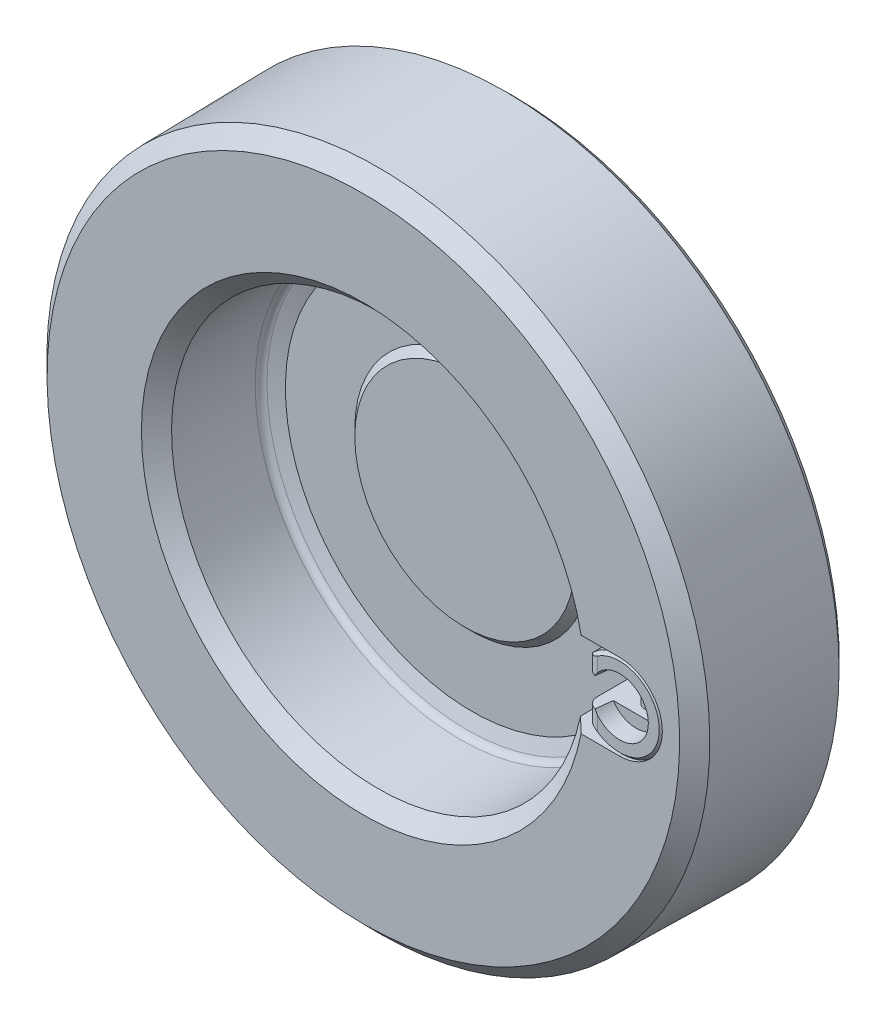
ISO-10303-21;
HEADER;
FILE_DESCRIPTION(('STEP AP214'),'2;1');
FILE_NAME('part.step','',(''),(''),'','','');
FILE_SCHEMA(('AUTOMOTIVE_DESIGN { 1 0 10303 214 1 1 1 1 }'));
ENDSEC;
DATA;
#1=APPLICATION_CONTEXT('core data for automotive mechanical design processes');
#2=APPLICATION_PROTOCOL_DEFINITION('international standard','automotive_design',2000,#1);
#3=PRODUCT_CONTEXT('',#1,'mechanical');
#4=PRODUCT('Part','Part','',(#3));
#5=PRODUCT_RELATED_PRODUCT_CATEGORY('part','',(#4));
#6=PRODUCT_DEFINITION_FORMATION('','',#4);
#7=PRODUCT_DEFINITION_CONTEXT('part definition',#1,'design');
#8=PRODUCT_DEFINITION('design','',#6,#7);
#9=PRODUCT_DEFINITION_SHAPE('','',#8);
#10=(LENGTH_UNIT() NAMED_UNIT(*) SI_UNIT(.MILLI.,.METRE.));
#11=(NAMED_UNIT(*) PLANE_ANGLE_UNIT() SI_UNIT($,.RADIAN.));
#12=(NAMED_UNIT(*) SI_UNIT($,.STERADIAN.) SOLID_ANGLE_UNIT());
#13=UNCERTAINTY_MEASURE_WITH_UNIT(LENGTH_MEASURE(1.E-05),#10,'distance_accuracy_value','');
#14=(GEOMETRIC_REPRESENTATION_CONTEXT(3) GLOBAL_UNCERTAINTY_ASSIGNED_CONTEXT((#13)) GLOBAL_UNIT_ASSIGNED_CONTEXT((#10,
#11,#12)) REPRESENTATION_CONTEXT('',''));
#15=CARTESIAN_POINT('',(0.,0.,0.));
#16=DIRECTION('',(0.,0.,1.));
#17=DIRECTION('',(1.,0.,0.));
#18=AXIS2_PLACEMENT_3D('',#15,#16,#17);
#19=CARTESIAN_POINT('',(-15.25,0.,0.));
#20=DIRECTION('',(0.,0.,1.));
#21=DIRECTION('',(0.,1.,0.));
#22=AXIS2_PLACEMENT_3D('',#19,#20,#21);
#23=PLANE('',#22);
#24=CARTESIAN_POINT('',(0.,0.,0.));
#25=DIRECTION('',(0.,0.,1.));
#26=DIRECTION('',(1.,0.,0.));
#27=AXIS2_PLACEMENT_3D('',#24,#25,#26);
#28=CIRCLE('',#27,15.25);
#29=CARTESIAN_POINT('',(15.25,0.,0.));
#30=VERTEX_POINT('',#29);
#31=EDGE_CURVE('E299',#30,#30,#28,.T.);
#32=ORIENTED_EDGE('',*,*,#31,.F.);
#33=EDGE_LOOP('',(#32));
#34=FACE_BOUND('',#33,.T.);
#35=ADVANCED_FACE('F14',(#34),#23,.F.);
#36=CARTESIAN_POINT('',(0.,0.,0.75));
#37=DIRECTION('',(0.,0.,1.));
#38=DIRECTION('',(1.,0.,0.));
#39=AXIS2_PLACEMENT_3D('',#36,#37,#38);
#40=CONICAL_SURFACE('',#39,16.,0.785398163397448);
#41=CARTESIAN_POINT('',(0.,0.,0.75));
#42=DIRECTION('',(0.,0.,1.));
#43=DIRECTION('',(0.,1.,0.));
#44=AXIS2_PLACEMENT_3D('',#41,#42,#43);
#45=CIRCLE('',#44,16.);
#46=CARTESIAN_POINT('',(0.,16.,0.75));
#47=VERTEX_POINT('',#46);
#48=EDGE_CURVE('E410',#47,#47,#45,.T.);
#49=ORIENTED_EDGE('',*,*,#48,.F.);
#50=EDGE_LOOP('',(#49));
#51=FACE_BOUND('',#50,.T.);
#52=ORIENTED_EDGE('',*,*,#31,.T.);
#53=EDGE_LOOP('',(#52));
#54=FACE_BOUND('',#53,.T.);
#55=ADVANCED_FACE('F399',(#51,#54),#40,.T.);
#56=CARTESIAN_POINT('',(0.,0.,0.));
#57=DIRECTION('',(0.,0.,1.));
#58=DIRECTION('',(0.,1.,0.));
#59=AXIS2_PLACEMENT_3D('',#56,#57,#58);
#60=CYLINDRICAL_SURFACE('',#59,16.);
#61=CARTESIAN_POINT('',(0.,0.,15.));
#62=DIRECTION('',(0.,0.,1.));
#63=DIRECTION('',(0.,1.,0.));
#64=AXIS2_PLACEMENT_3D('',#61,#62,#63);
#65=CIRCLE('',#64,16.);
#66=CARTESIAN_POINT('',(0.,16.,15.));
#67=VERTEX_POINT('',#66);
#68=EDGE_CURVE('E413',#67,#67,#65,.F.);
#69=ORIENTED_EDGE('',*,*,#68,.T.);
#70=EDGE_LOOP('',(#69));
#71=FACE_BOUND('',#70,.T.);
#72=ORIENTED_EDGE('',*,*,#48,.T.);
#73=EDGE_LOOP('',(#72));
#74=FACE_BOUND('',#73,.T.);
#75=ADVANCED_FACE('F405',(#71,#74),#60,.T.);
#76=CARTESIAN_POINT('',(-23.,0.,15.));
#77=DIRECTION('',(0.,0.,1.));
#78=DIRECTION('',(0.,1.,0.));
#79=AXIS2_PLACEMENT_3D('',#76,#77,#78);
#80=PLANE('',#79);
#81=CARTESIAN_POINT('',(0.,0.,15.));
#82=DIRECTION('',(0.,0.,1.));
#83=DIRECTION('',(0.,1.,0.));
#84=AXIS2_PLACEMENT_3D('',#81,#82,#83);
#85=CIRCLE('',#84,23.);
#86=CARTESIAN_POINT('',(0.,23.,15.));
#87=VERTEX_POINT('',#86);
#88=EDGE_CURVE('E555',#87,#87,#85,.T.);
#89=ORIENTED_EDGE('',*,*,#88,.F.);
#90=EDGE_LOOP('',(#89));
#91=FACE_BOUND('',#90,.T.);
#92=ORIENTED_EDGE('',*,*,#68,.F.);
#93=EDGE_LOOP('',(#92));
#94=FACE_BOUND('',#93,.T.);
#95=ADVANCED_FACE('F566',(#91,#94),#80,.F.);
#96=CARTESIAN_POINT('',(0.,0.,0.));
#97=DIRECTION('',(0.,0.,1.));
#98=DIRECTION('',(0.,1.,0.));
#99=AXIS2_PLACEMENT_3D('',#96,#97,#98);
#100=CYLINDRICAL_SURFACE('',#99,23.);
#101=CARTESIAN_POINT('',(0.,0.,24.1212414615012));
#102=DIRECTION('',(0.,0.,-1.));
#103=DIRECTION('',(0.,-1.,0.));
#104=AXIS2_PLACEMENT_3D('',#101,#102,#103);
#105=CIRCLE('',#104,23.);
#106=CARTESIAN_POINT('',(0.,-23.,24.1212414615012));
#107=VERTEX_POINT('',#106);
#108=EDGE_CURVE('E551',#107,#107,#105,.T.);
#109=ORIENTED_EDGE('',*,*,#108,.T.);
#110=EDGE_LOOP('',(#109));
#111=FACE_BOUND('',#110,.T.);
#112=ORIENTED_EDGE('',*,*,#88,.T.);
#113=EDGE_LOOP('',(#112));
#114=FACE_BOUND('',#113,.T.);
#115=ADVANCED_FACE('F568',(#111,#114),#100,.T.);
#116=CARTESIAN_POINT('',(0.,0.,24.121241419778));
#117=DIRECTION('',(0.,0.,-1.));
#118=DIRECTION('',(0.,-1.,0.));
#119=AXIS2_PLACEMENT_3D('',#116,#117,#118);
#120=TOROIDAL_SURFACE('',#119,25.8,2.8);
#121=CARTESIAN_POINT('',(0.,0.,26.5461125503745));
#122=DIRECTION('',(0.,0.,1.));
#123=DIRECTION('',(0.,1.,0.));
#124=AXIS2_PLACEMENT_3D('',#121,#122,#123);
#125=CIRCLE('',#124,24.4);
#126=CARTESIAN_POINT('',(0.,24.4,26.5461125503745));
#127=VERTEX_POINT('',#126);
#128=EDGE_CURVE('E550',#127,#127,#125,.T.);
#129=ORIENTED_EDGE('',*,*,#128,.F.);
#130=EDGE_LOOP('',(#129));
#131=FACE_BOUND('',#130,.T.);
#132=ORIENTED_EDGE('',*,*,#108,.F.);
#133=EDGE_LOOP('',(#132));
#134=FACE_BOUND('',#133,.T.);
#135=ADVANCED_FACE('F576',(#131,#134),#120,.F.);
#136=CARTESIAN_POINT('',(0.,0.,30.5875644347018));
#137=DIRECTION('',(0.,0.,1.));
#138=DIRECTION('',(1.,0.,0.));
#139=AXIS2_PLACEMENT_3D('',#136,#137,#138);
#140=CONICAL_SURFACE('',#139,31.4,1.0471975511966);
#141=CARTESIAN_POINT('',(0.,0.,30.5875644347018));
#142=DIRECTION('',(0.,0.,-1.));
#143=DIRECTION('',(0.,-1.,0.));
#144=AXIS2_PLACEMENT_3D('',#141,#142,#143);
#145=CIRCLE('',#144,31.4);
#146=CARTESIAN_POINT('',(0.,-31.4,30.5875644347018));
#147=VERTEX_POINT('',#146);
#148=EDGE_CURVE('E605',#147,#147,#145,.T.);
#149=ORIENTED_EDGE('',*,*,#148,.T.);
#150=EDGE_LOOP('',(#149));
#151=FACE_BOUND('',#150,.T.);
#152=ORIENTED_EDGE('',*,*,#128,.T.);
#153=EDGE_LOOP('',(#152));
#154=FACE_BOUND('',#153,.T.);
#155=ADVANCED_FACE('F592',(#151,#154),#140,.T.);
#156=CARTESIAN_POINT('',(0.,0.,29.3751288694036));
#157=DIRECTION('',(0.,0.,-1.));
#158=DIRECTION('',(0.,-1.,0.));
#159=AXIS2_PLACEMENT_3D('',#156,#157,#158);
#160=TOROIDAL_SURFACE('',#159,32.1,1.4);
#161=CARTESIAN_POINT('',(0.,0.,29.3751288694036));
#162=DIRECTION('',(0.,0.,1.));
#163=DIRECTION('',(0.,1.,0.));
#164=AXIS2_PLACEMENT_3D('',#161,#162,#163);
#165=CIRCLE('',#164,33.5);
#166=CARTESIAN_POINT('',(0.,33.5,29.3751288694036));
#167=VERTEX_POINT('',#166);
#168=EDGE_CURVE('E542',#167,#167,#165,.F.);
#169=ORIENTED_EDGE('',*,*,#168,.T.);
#170=EDGE_LOOP('',(#169));
#171=FACE_BOUND('',#170,.T.);
#172=ORIENTED_EDGE('',*,*,#148,.F.);
#173=EDGE_LOOP('',(#172));
#174=FACE_BOUND('',#173,.T.);
#175=ADVANCED_FACE('F530',(#171,#174),#160,.F.);
#176=CARTESIAN_POINT('',(0.,0.,38.));
#177=DIRECTION('',(0.,0.,-1.));
#178=DIRECTION('',(0.,-1.,0.));
#179=AXIS2_PLACEMENT_3D('',#176,#177,#178);
#180=PLANE('',#179);
#181=CARTESIAN_POINT('',(0.,0.,38.));
#182=DIRECTION('',(0.,0.,-1.));
#183=DIRECTION('',(-1.,0.,0.));
#184=AXIS2_PLACEMENT_3D('',#181,#182,#183);
#185=CIRCLE('',#184,20.6);
#186=CARTESIAN_POINT('',(-20.6,0.,38.));
#187=VERTEX_POINT('',#186);
#188=EDGE_CURVE('E557',#187,#187,#185,.T.);
#189=ORIENTED_EDGE('',*,*,#188,.F.);
#190=EDGE_LOOP('',(#189));
#191=FACE_BOUND('',#190,.T.);
#192=ADVANCED_FACE('F583',(#191),#180,.F.);
#193=CARTESIAN_POINT('',(0.,0.,0.));
#194=DIRECTION('',(0.,0.,1.));
#195=DIRECTION('',(0.,1.,0.));
#196=AXIS2_PLACEMENT_3D('',#193,#194,#195);
#197=CYLINDRICAL_SURFACE('',#196,33.5);
#198=CARTESIAN_POINT('',(0.,0.,29.));
#199=DIRECTION('',(0.,0.,1.));
#200=DIRECTION('',(0.,1.,0.));
#201=AXIS2_PLACEMENT_3D('',#198,#199,#200);
#202=CIRCLE('',#201,33.5);
#203=CARTESIAN_POINT('',(0.,33.5,29.));
#204=VERTEX_POINT('',#203);
#205=EDGE_CURVE('E653',#204,#204,#202,.F.);
#206=ORIENTED_EDGE('',*,*,#205,.T.);
#207=EDGE_LOOP('',(#206));
#208=FACE_BOUND('',#207,.T.);
#209=ORIENTED_EDGE('',*,*,#168,.F.);
#210=EDGE_LOOP('',(#209));
#211=FACE_BOUND('',#210,.T.);
#212=ADVANCED_FACE('F444',(#208,#211),#197,.F.);
#213=CARTESIAN_POINT('',(0.,0.,36.6));
#214=DIRECTION('',(0.,0.,-1.));
#215=DIRECTION('',(-1.,0.,0.));
#216=AXIS2_PLACEMENT_3D('',#213,#214,#215);
#217=CONICAL_SURFACE('',#216,22.,0.785398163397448);
#218=ORIENTED_EDGE('',*,*,#188,.T.);
#219=EDGE_LOOP('',(#218));
#220=FACE_BOUND('',#219,.T.);
#221=CARTESIAN_POINT('',(0.,0.,36.6));
#222=DIRECTION('',(0.,0.,-1.));
#223=DIRECTION('',(-1.,0.,0.));
#224=AXIS2_PLACEMENT_3D('',#221,#222,#223);
#225=CIRCLE('',#224,22.);
#226=CARTESIAN_POINT('',(-22.,0.,36.6));
#227=VERTEX_POINT('',#226);
#228=EDGE_CURVE('E552',#227,#227,#225,.F.);
#229=ORIENTED_EDGE('',*,*,#228,.T.);
#230=EDGE_LOOP('',(#229));
#231=FACE_BOUND('',#230,.T.);
#232=ADVANCED_FACE('F497',(#220,#231),#217,.T.);
#233=CARTESIAN_POINT('',(-61.1244370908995,0.,29.));
#234=DIRECTION('',(0.,0.,1.));
#235=DIRECTION('',(0.,1.,0.));
#236=AXIS2_PLACEMENT_3D('',#233,#234,#235);
#237=PLANE('',#236);
#238=CARTESIAN_POINT('',(0.,0.,29.));
#239=DIRECTION('',(0.,0.,1.));
#240=DIRECTION('',(0.,1.,0.));
#241=AXIS2_PLACEMENT_3D('',#238,#239,#240);
#242=CIRCLE('',#241,61.1244370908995);
#243=CARTESIAN_POINT('',(0.,61.1244370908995,29.));
#244=VERTEX_POINT('',#243);
#245=EDGE_CURVE('E644',#244,#244,#242,.T.);
#246=ORIENTED_EDGE('',*,*,#245,.F.);
#247=EDGE_LOOP('',(#246));
#248=FACE_BOUND('',#247,.T.);
#249=ORIENTED_EDGE('',*,*,#205,.F.);
#250=EDGE_LOOP('',(#249));
#251=FACE_BOUND('',#250,.T.);
#252=ADVANCED_FACE('F495',(#248,#251),#237,.F.);
#253=CARTESIAN_POINT('',(-22.,0.,36.6));
#254=DIRECTION('',(0.,0.,-1.));
#255=DIRECTION('',(0.,-1.,0.));
#256=AXIS2_PLACEMENT_3D('',#253,#254,#255);
#257=PLANE('',#256);
#258=ORIENTED_EDGE('',*,*,#228,.F.);
#259=EDGE_LOOP('',(#258));
#260=FACE_BOUND('',#259,.T.);
#261=CARTESIAN_POINT('',(0.,0.,36.6));
#262=DIRECTION('',(0.,0.,1.));
#263=DIRECTION('',(0.,1.,0.));
#264=AXIS2_PLACEMENT_3D('',#261,#262,#263);
#265=CIRCLE('',#264,35.);
#266=CARTESIAN_POINT('',(0.,35.,36.6));
#267=VERTEX_POINT('',#266);
#268=EDGE_CURVE('E547',#267,#267,#265,.T.);
#269=ORIENTED_EDGE('',*,*,#268,.T.);
#270=EDGE_LOOP('',(#269));
#271=FACE_BOUND('',#270,.T.);
#272=ADVANCED_FACE('F489',(#260,#271),#257,.F.);
#273=CARTESIAN_POINT('',(0.,0.,30.3997867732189));
#274=DIRECTION('',(0.,0.,1.));
#275=DIRECTION('',(0.,1.,0.));
#276=AXIS2_PLACEMENT_3D('',#273,#274,#275);
#277=CONICAL_SURFACE('',#276,62.5000037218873,0.77667151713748);
#278=CARTESIAN_POINT('',(0.,0.,30.3997867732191));
#279=DIRECTION('',(0.,0.,-1.));
#280=DIRECTION('',(0.,-1.,0.));
#281=AXIS2_PLACEMENT_3D('',#278,#279,#280);
#282=CIRCLE('',#281,62.5000037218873);
#283=CARTESIAN_POINT('',(0.,-62.5000037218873,30.399786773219));
#284=VERTEX_POINT('',#283);
#285=EDGE_CURVE('E643',#284,#284,#282,.F.);
#286=ORIENTED_EDGE('',*,*,#285,.F.);
#287=EDGE_LOOP('',(#286));
#288=FACE_BOUND('',#287,.T.);
#289=ORIENTED_EDGE('',*,*,#245,.T.);
#290=EDGE_LOOP('',(#289));
#291=FACE_BOUND('',#290,.T.);
#292=ADVANCED_FACE('F485',(#288,#291),#277,.T.);
#293=CARTESIAN_POINT('',(48.,0.,42.5));
#294=DIRECTION('',(0.,0.,1.));
#295=DIRECTION('',(0.,1.,0.));
#296=AXIS2_PLACEMENT_3D('',#293,#294,#295);
#297=PLANE('',#296);
#298=CARTESIAN_POINT('',(49.,0.,42.5));
#299=DIRECTION('',(0.,0.,1.));
#300=DIRECTION('',(0.,1.,0.));
#301=AXIS2_PLACEMENT_3D('',#298,#299,#300);
#302=CIRCLE('',#301,2.00000000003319);
#303=CARTESIAN_POINT('',(49.,2.00000000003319,42.5));
#304=VERTEX_POINT('',#303);
#305=EDGE_CURVE('E706',#304,#304,#302,.T.);
#306=ORIENTED_EDGE('',*,*,#305,.T.);
#307=EDGE_LOOP('',(#306));
#308=FACE_BOUND('',#307,.T.);
#309=ADVANCED_FACE('F488',(#308),#297,.T.);
#310=CARTESIAN_POINT('',(0.,0.,37.5193283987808));
#311=DIRECTION('',(0.,0.,1.));
#312=DIRECTION('',(0.,1.,0.));
#313=AXIS2_PLACEMENT_3D('',#310,#311,#312);
#314=CONICAL_SURFACE('',#313,37.5258340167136,1.22173047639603);
#315=ORIENTED_EDGE('',*,*,#268,.F.);
#316=EDGE_LOOP('',(#315));
#317=FACE_BOUND('',#316,.T.);
#318=CARTESIAN_POINT('',(0.,0.,37.5193283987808));
#319=DIRECTION('',(0.,0.,-1.));
#320=DIRECTION('',(0.,-1.,0.));
#321=AXIS2_PLACEMENT_3D('',#318,#319,#320);
#322=CIRCLE('',#321,37.5258340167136);
#323=CARTESIAN_POINT('',(0.,-37.5258340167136,37.5193283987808));
#324=VERTEX_POINT('',#323);
#325=EDGE_CURVE('E606',#324,#324,#322,.F.);
#326=ORIENTED_EDGE('',*,*,#325,.T.);
#327=EDGE_LOOP('',(#326));
#328=FACE_BOUND('',#327,.T.);
#329=ADVANCED_FACE('F478',(#317,#328),#314,.F.);
#330=CARTESIAN_POINT('',(0.,0.,30.3997867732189));
#331=DIRECTION('',(0.,0.,-1.));
#332=DIRECTION('',(0.,-1.,0.));
#333=AXIS2_PLACEMENT_3D('',#330,#331,#332);
#334=CONICAL_SURFACE('',#333,62.5000037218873,0.017453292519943);
#335=CARTESIAN_POINT('',(0.,0.,54.2004264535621));
#336=DIRECTION('',(0.,0.,-1.));
#337=DIRECTION('',(0.,-1.,0.));
#338=AXIS2_PLACEMENT_3D('',#335,#336,#337);
#339=CIRCLE('',#338,62.0845620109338);
#340=CARTESIAN_POINT('',(0.,-62.0845620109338,54.2004264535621));
#341=VERTEX_POINT('',#340);
#342=EDGE_CURVE('E427',#341,#341,#339,.T.);
#343=ORIENTED_EDGE('',*,*,#342,.T.);
#344=EDGE_LOOP('',(#343));
#345=FACE_BOUND('',#344,.T.);
#346=ORIENTED_EDGE('',*,*,#285,.T.);
#347=EDGE_LOOP('',(#346));
#348=FACE_BOUND('',#347,.T.);
#349=ADVANCED_FACE('F475',(#345,#348),#334,.T.);
#350=CARTESIAN_POINT('',(49.,0.,42.5000000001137));
#351=DIRECTION('',(0.,0.,-1.));
#352=DIRECTION('',(-1.,0.,0.));
#353=AXIS2_PLACEMENT_3D('',#350,#351,#352);
#354=CONICAL_SURFACE('',#353,1.99999999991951,0.785398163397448);
#355=CARTESIAN_POINT('',(49.,0.,42.8790000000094));
#356=DIRECTION('',(0.,0.,-1.));
#357=DIRECTION('',(-1.,0.,0.));
#358=AXIS2_PLACEMENT_3D('',#355,#356,#357);
#359=CIRCLE('',#358,1.62100000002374);
#360=CARTESIAN_POINT('',(47.3789999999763,0.,42.8790000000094));
#361=VERTEX_POINT('',#360);
#362=EDGE_CURVE('E246',#361,#361,#359,.T.);
#363=ORIENTED_EDGE('',*,*,#362,.F.);
#364=EDGE_LOOP('',(#363));
#365=FACE_BOUND('',#364,.T.);
#366=ORIENTED_EDGE('',*,*,#305,.F.);
#367=EDGE_LOOP('',(#366));
#368=FACE_BOUND('',#367,.T.);
#369=ADVANCED_FACE('F233',(#365,#368),#354,.F.);
#370=CARTESIAN_POINT('',(0.,0.,38.8348980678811));
#371=DIRECTION('',(0.,0.,-1.));
#372=DIRECTION('',(0.,-1.,0.));
#373=AXIS2_PLACEMENT_3D('',#370,#371,#372);
#374=TOROIDAL_SURFACE('',#373,37.0470058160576,1.4);
#375=ORIENTED_EDGE('',*,*,#325,.F.);
#376=EDGE_LOOP('',(#375));
#377=FACE_BOUND('',#376,.T.);
#378=CARTESIAN_POINT('',(0.,0.,38.8104646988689));
#379=DIRECTION('',(0.,0.,1.));
#380=DIRECTION('',(0.,1.,0.));
#381=AXIS2_PLACEMENT_3D('',#378,#379,#380);
#382=CIRCLE('',#381,38.4467925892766);
#383=CARTESIAN_POINT('',(0.,38.4467925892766,38.8104646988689));
#384=VERTEX_POINT('',#383);
#385=EDGE_CURVE('E546',#384,#384,#382,.T.);
#386=ORIENTED_EDGE('',*,*,#385,.T.);
#387=EDGE_LOOP('',(#386));
#388=FACE_BOUND('',#387,.T.);
#389=ADVANCED_FACE('F483',(#377,#388),#374,.F.);
#390=CARTESIAN_POINT('',(0.,0.,54.2004264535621));
#391=DIRECTION('',(0.,0.,-1.));
#392=DIRECTION('',(0.,-1.,0.));
#393=AXIS2_PLACEMENT_3D('',#390,#391,#392);
#394=CONICAL_SURFACE('',#393,62.0845620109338,0.794124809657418);
#395=CARTESIAN_POINT('',(0.,0.,57.));
#396=DIRECTION('',(0.,0.,-1.));
#397=DIRECTION('',(0.,-1.,0.));
#398=AXIS2_PLACEMENT_3D('',#395,#396,#397);
#399=CIRCLE('',#398,59.2356952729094);
#400=CARTESIAN_POINT('',(0.,-59.2356952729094,57.));
#401=VERTEX_POINT('',#400);
#402=EDGE_CURVE('E640',#401,#401,#399,.T.);
#403=ORIENTED_EDGE('',*,*,#402,.T.);
#404=EDGE_LOOP('',(#403));
#405=FACE_BOUND('',#404,.T.);
#406=ORIENTED_EDGE('',*,*,#342,.F.);
#407=EDGE_LOOP('',(#406));
#408=FACE_BOUND('',#407,.T.);
#409=ADVANCED_FACE('F480',(#405,#408),#394,.T.);
#410=CARTESIAN_POINT('',(55.42,0.,57.));
#411=DIRECTION('',(0.,0.,-1.));
#412=DIRECTION('',(0.,-1.,0.));
#413=AXIS2_PLACEMENT_3D('',#410,#411,#412);
#414=PLANE('',#413);
#415=CARTESIAN_POINT('',(48.,0.,57.));
#416=DIRECTION('',(0.,0.,-1.));
#417=DIRECTION('',(0.,-1.,0.));
#418=AXIS2_PLACEMENT_3D('',#415,#416,#417);
#419=CIRCLE('',#418,7.42);
#420=CARTESIAN_POINT('',(43.84,6.14416796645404,57.));
#421=VERTEX_POINT('',#420);
#422=CARTESIAN_POINT('',(43.84,-6.14416796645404,57.));
#423=VERTEX_POINT('',#422);
#424=EDGE_CURVE('E192',#421,#423,#419,.T.);
#425=ORIENTED_EDGE('',*,*,#424,.F.);
#426=DIRECTION('',(0.,1.,0.));
#427=VECTOR('',#426,1.);
#428=CARTESIAN_POINT('',(43.84,14.5,57.));
#429=LINE('',#428,#427);
#430=CARTESIAN_POINT('',(43.84,3.40367815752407,56.9999999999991));
#431=VERTEX_POINT('',#430);
#432=EDGE_CURVE('E175',#431,#421,#429,.T.);
#433=ORIENTED_EDGE('',*,*,#432,.F.);
#434=CARTESIAN_POINT('',(48.,0.,56.9999999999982));
#435=DIRECTION('',(0.,0.,1.));
#436=DIRECTION('',(1.,0.,0.));
#437=AXIS2_PLACEMENT_3D('',#434,#435,#436);
#438=CIRCLE('',#437,5.3750000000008);
#439=CARTESIAN_POINT('',(43.84,-3.40367815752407,56.9999999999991));
#440=VERTEX_POINT('',#439);
#441=EDGE_CURVE('E182',#440,#431,#438,.T.);
#442=ORIENTED_EDGE('',*,*,#441,.F.);
#443=DIRECTION('',(0.,1.,0.));
#444=VECTOR('',#443,1.);
#445=CARTESIAN_POINT('',(43.84,14.5,57.));
#446=LINE('',#445,#444);
#447=EDGE_CURVE('E200',#423,#440,#446,.T.);
#448=ORIENTED_EDGE('',*,*,#447,.F.);
#449=EDGE_LOOP('',(#425,#433,#442,#448));
#450=FACE_BOUND('',#449,.T.);
#451=ADVANCED_FACE('F191',(#450),#414,.F.);
#452=CARTESIAN_POINT('',(48.,0.,56.42));
#453=DIRECTION('',(0.,0.,-1.));
#454=DIRECTION('',(0.,-1.,0.));
#455=AXIS2_PLACEMENT_3D('',#452,#453,#454);
#456=CONICAL_SURFACE('',#455,7.99999999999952,0.785398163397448);
#457=CARTESIAN_POINT('',(48.,0.,56.42));
#458=DIRECTION('',(0.,0.,-1.));
#459=DIRECTION('',(0.,-1.,0.));
#460=AXIS2_PLACEMENT_3D('',#457,#458,#459);
#461=CIRCLE('',#460,8.);
#462=CARTESIAN_POINT('',(42.3360053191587,5.64970479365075,56.42));
#463=VERTEX_POINT('',#462);
#464=CARTESIAN_POINT('',(48.,8.,56.42));
#465=VERTEX_POINT('',#464);
#466=EDGE_CURVE('E329',#463,#465,#461,.T.);
#467=ORIENTED_EDGE('',*,*,#466,.F.);
#468=CARTESIAN_POINT('',(42.3360053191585,5.64970479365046,56.42));
#469=CARTESIAN_POINT('',(42.3610283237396,5.64268022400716,56.4426757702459));
#470=CARTESIAN_POINT('',(42.3867504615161,5.63689398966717,56.4649444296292));
#471=CARTESIAN_POINT('',(42.4394357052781,5.62783307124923,56.5084809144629));
#472=CARTESIAN_POINT('',(42.4663983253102,5.6245574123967,56.529749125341));
#473=CARTESIAN_POINT('',(42.5484457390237,5.61857792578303,56.5914269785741));
#474=CARTESIAN_POINT('',(42.6051459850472,5.61959438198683,56.630124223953));
#475=CARTESIAN_POINT('',(42.7210483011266,5.63089045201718,56.7016993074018));
#476=CARTESIAN_POINT('',(42.7802475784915,5.64115997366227,56.7345834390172));
#477=CARTESIAN_POINT('',(42.8999090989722,5.66952441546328,56.7942850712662));
#478=CARTESIAN_POINT('',(42.9603737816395,5.68763609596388,56.8210893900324));
#479=CARTESIAN_POINT('',(43.1151508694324,5.741932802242,56.881896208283));
#480=CARTESIAN_POINT('',(43.2095779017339,5.78256683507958,56.9116059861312));
#481=CARTESIAN_POINT('',(43.3967534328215,5.87404631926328,56.9578348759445));
#482=CARTESIAN_POINT('',(43.489496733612,5.92491894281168,56.9743182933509));
#483=CARTESIAN_POINT('',(43.6248234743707,6.00534334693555,56.990080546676));
#484=CARTESIAN_POINT('',(43.6685138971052,6.03229542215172,56.9938484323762));
#485=CARTESIAN_POINT('',(43.7549225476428,6.08737599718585,56.9987990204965));
#486=CARTESIAN_POINT('',(43.7976450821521,6.11549631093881,56.9999973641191));
#487=CARTESIAN_POINT('',(43.84,6.14416796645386,57.));
#488=B_SPLINE_CURVE_WITH_KNOTS('',3,(#468,#469,#470,#471,#472,#473,#474,#475,#476,#477,#478,
#479,#480,#481,#482,#483,#484,#485,#486,#487),.UNSPECIFIED.,.F.,.F.,(4,2,2,2,2,2,2,2,2,4),(0.,
0.103417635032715,0.206795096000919,0.411688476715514,0.61635865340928,0.821468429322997,
1.14069840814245,1.46078703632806,1.61513549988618,1.76854172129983),.UNSPECIFIED.);
#489=EDGE_CURVE('E194',#463,#421,#488,.T.);
#490=ORIENTED_EDGE('',*,*,#489,.T.);
#491=ORIENTED_EDGE('',*,*,#424,.T.);
#492=CARTESIAN_POINT('',(42.3360053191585,-5.64970479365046,56.42));
#493=CARTESIAN_POINT('',(42.3610283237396,-5.64268022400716,56.4426757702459));
#494=CARTESIAN_POINT('',(42.3867504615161,-5.63689398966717,56.4649444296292));
#495=CARTESIAN_POINT('',(42.4394357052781,-5.62783307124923,56.5084809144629));
#496=CARTESIAN_POINT('',(42.4663983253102,-5.6245574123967,56.529749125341));
#497=CARTESIAN_POINT('',(42.5484457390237,-5.61857792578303,56.5914269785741));
#498=CARTESIAN_POINT('',(42.6051459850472,-5.61959438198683,56.630124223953));
#499=CARTESIAN_POINT('',(42.7210483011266,-5.63089045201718,56.7016993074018));
#500=CARTESIAN_POINT('',(42.7802475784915,-5.64115997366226,56.7345834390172));
#501=CARTESIAN_POINT('',(42.8999090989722,-5.66952441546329,56.7942850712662));
#502=CARTESIAN_POINT('',(42.9603737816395,-5.68763609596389,56.8210893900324));
#503=CARTESIAN_POINT('',(43.1151508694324,-5.74193280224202,56.8818962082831));
#504=CARTESIAN_POINT('',(43.2095779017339,-5.7825668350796,56.9116059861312));
#505=CARTESIAN_POINT('',(43.3967534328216,-5.87404631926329,56.9578348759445));
#506=CARTESIAN_POINT('',(43.489496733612,-5.92491894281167,56.9743182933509));
#507=CARTESIAN_POINT('',(43.6248234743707,-6.00534334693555,56.990080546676));
#508=CARTESIAN_POINT('',(43.6685138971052,-6.03229542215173,56.9938484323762));
#509=CARTESIAN_POINT('',(43.7549225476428,-6.08737599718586,56.9987990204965));
#510=CARTESIAN_POINT('',(43.7976450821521,-6.11549631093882,56.9999973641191));
#511=CARTESIAN_POINT('',(43.84,-6.14416796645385,57.));
#512=B_SPLINE_CURVE_WITH_KNOTS('',3,(#492,#493,#494,#495,#496,#497,#498,#499,#500,#501,#502,
#503,#504,#505,#506,#507,#508,#509,#510,#511),.UNSPECIFIED.,.F.,.F.,(4,2,2,2,2,2,2,2,2,4),(0.,
0.103417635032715,0.206795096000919,0.411688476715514,0.61635865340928,0.821468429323,
1.14069840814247,1.46078703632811,1.6151354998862,1.76854172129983),.UNSPECIFIED.);
#513=CARTESIAN_POINT('',(42.3360053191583,-5.64970479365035,56.42));
#514=VERTEX_POINT('',#513);
#515=EDGE_CURVE('E347',#514,#423,#512,.T.);
#516=ORIENTED_EDGE('',*,*,#515,.F.);
#517=CARTESIAN_POINT('',(48.,-8.,56.42));
#518=VERTEX_POINT('',#517);
#519=EDGE_CURVE('E1093',#518,#514,#461,.T.);
#520=ORIENTED_EDGE('',*,*,#519,.F.);
#521=CARTESIAN_POINT('',(48.,0.,56.42));
#522=DIRECTION('',(0.,0.,-1.));
#523=DIRECTION('',(0.,-1.,0.));
#524=AXIS2_PLACEMENT_3D('',#521,#522,#523);
#525=CIRCLE('',#524,8.);
#526=EDGE_CURVE('E696',#465,#518,#525,.T.);
#527=ORIENTED_EDGE('',*,*,#526,.F.);
#528=EDGE_LOOP('',(#467,#490,#491,#516,#520,#527));
#529=FACE_BOUND('',#528,.T.);
#530=ADVANCED_FACE('F342',(#529),#456,.T.);
#531=CARTESIAN_POINT('',(48.,0.,42.5));
#532=DIRECTION('',(0.,0.,1.));
#533=DIRECTION('',(0.,1.,0.));
#534=AXIS2_PLACEMENT_3D('',#531,#532,#533);
#535=CIRCLE('',#534,8.);
#536=CARTESIAN_POINT('',(41.6,-4.8,42.5));
#537=VERTEX_POINT('',#536);
#538=CARTESIAN_POINT('',(48.,-8.,42.5));
#539=VERTEX_POINT('',#538);
#540=EDGE_CURVE('E1080',#537,#539,#535,.T.);
#541=ORIENTED_EDGE('',*,*,#540,.F.);
#542=DIRECTION('',(0.,-1.,0.));
#543=VECTOR('',#542,1.);
#544=CARTESIAN_POINT('',(41.6,0.,42.5));
#545=LINE('',#544,#543);
#546=CARTESIAN_POINT('',(41.6,4.8,42.5));
#547=VERTEX_POINT('',#546);
#548=EDGE_CURVE('E1083',#547,#537,#545,.T.);
#549=ORIENTED_EDGE('',*,*,#548,.F.);
#550=CARTESIAN_POINT('',(48.,8.,42.5));
#551=VERTEX_POINT('',#550);
#552=EDGE_CURVE('E1060',#551,#547,#535,.T.);
#553=ORIENTED_EDGE('',*,*,#552,.F.);
#554=DIRECTION('',(1.,0.,0.));
#555=VECTOR('',#554,1.);
#556=CARTESIAN_POINT('',(48.,8.,42.5));
#557=LINE('',#556,#555);
#558=CARTESIAN_POINT('',(37.6711034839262,8.,42.5));
#559=VERTEX_POINT('',#558);
#560=EDGE_CURVE('E541',#559,#551,#557,.T.);
#561=ORIENTED_EDGE('',*,*,#560,.F.);
#562=CARTESIAN_POINT('',(0.,0.,42.5));
#563=DIRECTION('',(0.,0.,1.));
#564=DIRECTION('',(0.,1.,0.));
#565=AXIS2_PLACEMENT_3D('',#562,#563,#564);
#566=CIRCLE('',#565,38.5111936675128);
#567=CARTESIAN_POINT('',(37.6711034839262,-8.,42.5));
#568=VERTEX_POINT('',#567);
#569=EDGE_CURVE('E543',#559,#568,#566,.F.);
#570=ORIENTED_EDGE('',*,*,#569,.T.);
#571=DIRECTION('',(-1.,0.,0.));
#572=VECTOR('',#571,1.);
#573=CARTESIAN_POINT('',(0.,-8.,42.5));
#574=LINE('',#573,#572);
#575=EDGE_CURVE('E655',#539,#568,#574,.T.);
#576=ORIENTED_EDGE('',*,*,#575,.F.);
#577=EDGE_LOOP('',(#541,#549,#553,#561,#570,#576));
#578=FACE_BOUND('',#577,.T.);
#579=ADVANCED_FACE('F528',(#578),#297,.T.);
#580=CARTESIAN_POINT('',(0.,0.,54.2004264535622));
#581=DIRECTION('',(0.,0.,1.));
#582=DIRECTION('',(0.,1.,0.));
#583=AXIS2_PLACEMENT_3D('',#580,#581,#582);
#584=CONICAL_SURFACE('',#583,38.7154253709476,0.0174532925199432);
#585=ORIENTED_EDGE('',*,*,#385,.F.);
#586=EDGE_LOOP('',(#585));
#587=FACE_BOUND('',#586,.T.);
#588=CARTESIAN_POINT('',(37.6711034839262,-8.,42.5));
#589=CARTESIAN_POINT('',(37.7059011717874,-8.,44.4500710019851));
#590=CARTESIAN_POINT('',(37.7406967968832,-8.,46.4001420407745));
#591=CARTESIAN_POINT('',(37.810283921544,-8.,50.3002841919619));
#592=CARTESIAN_POINT('',(37.8450754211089,-8.,52.2503553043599));
#593=CARTESIAN_POINT('',(37.8798648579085,-8.,54.2004264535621));
#594=B_SPLINE_CURVE_WITH_KNOTS('',3,(#588,#589,#590,#591,#592,#593),.UNSPECIFIED.,.F.,.F.,(4,2,
4),(0.,5.85114434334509,11.7022886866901),.UNSPECIFIED.);
#595=CARTESIAN_POINT('',(37.8798648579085,-8.,54.2004264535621));
#596=VERTEX_POINT('',#595);
#597=EDGE_CURVE('E510',#568,#596,#594,.T.);
#598=ORIENTED_EDGE('',*,*,#597,.F.);
#599=ORIENTED_EDGE('',*,*,#569,.F.);
#600=CARTESIAN_POINT('',(37.8798648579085,8.,54.2004264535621));
#601=CARTESIAN_POINT('',(37.8450754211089,8.,52.2503553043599));
#602=CARTESIAN_POINT('',(37.810283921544,8.,50.3002841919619));
#603=CARTESIAN_POINT('',(37.7406967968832,8.,46.4001420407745));
#604=CARTESIAN_POINT('',(37.7059011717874,8.,44.4500710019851));
#605=CARTESIAN_POINT('',(37.6711034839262,8.,42.5));
#606=B_SPLINE_CURVE_WITH_KNOTS('',3,(#600,#601,#602,#603,#604,#605),.UNSPECIFIED.,.F.,.F.,(4,2,
4),(0.,5.85114434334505,11.7022886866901),.UNSPECIFIED.);
#607=CARTESIAN_POINT('',(37.8798648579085,8.,54.2004264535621));
#608=VERTEX_POINT('',#607);
#609=EDGE_CURVE('E534',#608,#559,#606,.T.);
#610=ORIENTED_EDGE('',*,*,#609,.F.);
#611=CARTESIAN_POINT('',(0.,0.,54.2004264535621));
#612=DIRECTION('',(0.,0.,1.));
#613=DIRECTION('',(0.,1.,0.));
#614=AXIS2_PLACEMENT_3D('',#611,#612,#613);
#615=CIRCLE('',#614,38.7154253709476);
#616=EDGE_CURVE('E670',#608,#596,#615,.T.);
#617=ORIENTED_EDGE('',*,*,#616,.T.);
#618=EDGE_LOOP('',(#598,#599,#610,#617));
#619=FACE_BOUND('',#618,.T.);
#620=ADVANCED_FACE('F524',(#587,#619),#584,.F.);
#621=CARTESIAN_POINT('',(0.,0.,57.));
#622=DIRECTION('',(0.,0.,1.));
#623=DIRECTION('',(1.,0.,0.));
#624=AXIS2_PLACEMENT_3D('',#621,#622,#623);
#625=CONICAL_SURFACE('',#624,41.5642921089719,0.794124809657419);
#626=CARTESIAN_POINT('',(0.,0.,57.));
#627=DIRECTION('',(0.,0.,1.));
#628=DIRECTION('',(1.,0.,0.));
#629=AXIS2_PLACEMENT_3D('',#626,#627,#628);
#630=CIRCLE('',#629,41.5642921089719);
#631=CARTESIAN_POINT('',(40.7871349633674,8.,57.));
#632=VERTEX_POINT('',#631);
#633=CARTESIAN_POINT('',(40.7871349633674,-8.,57.));
#634=VERTEX_POINT('',#633);
#635=EDGE_CURVE('E648',#632,#634,#630,.T.);
#636=ORIENTED_EDGE('',*,*,#635,.T.);
#637=CARTESIAN_POINT('',(37.8798648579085,-8.,54.2004264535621));
#638=CARTESIAN_POINT('',(38.3647525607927,-8.,54.6666661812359));
#639=CARTESIAN_POINT('',(38.8494689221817,-8.,55.1330838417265));
#640=CARTESIAN_POINT('',(39.8185589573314,-8.,56.0662750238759));
#641=CARTESIAN_POINT('',(40.3029326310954,-8.,56.5330485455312));
#642=CARTESIAN_POINT('',(40.7871349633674,-8.,57.));
#643=B_SPLINE_CURVE_WITH_KNOTS('',3,(#637,#638,#639,#640,#641,#642),.UNSPECIFIED.,.F.,.F.,(4,2,
4),(0.,2.01803331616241,4.03606661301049),.UNSPECIFIED.);
#644=EDGE_CURVE('E503',#596,#634,#643,.T.);
#645=ORIENTED_EDGE('',*,*,#644,.F.);
#646=ORIENTED_EDGE('',*,*,#616,.F.);
#647=CARTESIAN_POINT('',(40.7871349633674,8.,57.));
#648=CARTESIAN_POINT('',(40.3029326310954,8.,56.5330485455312));
#649=CARTESIAN_POINT('',(39.8185589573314,8.,56.0662750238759));
#650=CARTESIAN_POINT('',(38.8494689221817,8.,55.1330838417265));
#651=CARTESIAN_POINT('',(38.3647525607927,8.,54.6666661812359));
#652=CARTESIAN_POINT('',(37.8798648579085,8.,54.2004264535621));
#653=B_SPLINE_CURVE_WITH_KNOTS('',3,(#647,#648,#649,#650,#651,#652),.UNSPECIFIED.,.F.,.F.,(4,2,
4),(0.,2.01803329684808,4.03606661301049),.UNSPECIFIED.);
#654=EDGE_CURVE('E518',#632,#608,#653,.T.);
#655=ORIENTED_EDGE('',*,*,#654,.F.);
#656=EDGE_LOOP('',(#636,#645,#646,#655));
#657=FACE_BOUND('',#656,.T.);
#658=ADVANCED_FACE('F493',(#657),#625,.F.);
#659=CARTESIAN_POINT('',(-41.5642921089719,0.,57.));
#660=DIRECTION('',(0.,0.,-1.));
#661=DIRECTION('',(0.,-1.,0.));
#662=AXIS2_PLACEMENT_3D('',#659,#660,#661);
#663=PLANE('',#662);
#664=ORIENTED_EDGE('',*,*,#635,.F.);
#665=DIRECTION('',(-1.,0.,0.));
#666=VECTOR('',#665,1.);
#667=CARTESIAN_POINT('',(-41.5642921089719,8.,57.));
#668=LINE('',#667,#666);
#669=CARTESIAN_POINT('',(48.,8.,57.));
#670=VERTEX_POINT('',#669);
#671=EDGE_CURVE('E650',#670,#632,#668,.T.);
#672=ORIENTED_EDGE('',*,*,#671,.F.);
#673=CARTESIAN_POINT('',(48.,0.,57.));
#674=DIRECTION('',(0.,0.,1.));
#675=DIRECTION('',(0.,1.,0.));
#676=AXIS2_PLACEMENT_3D('',#673,#674,#675);
#677=CIRCLE('',#676,8.);
#678=CARTESIAN_POINT('',(48.,-8.,57.));
#679=VERTEX_POINT('',#678);
#680=EDGE_CURVE('E651',#679,#670,#677,.T.);
#681=ORIENTED_EDGE('',*,*,#680,.F.);
#682=DIRECTION('',(-1.,0.,0.));
#683=VECTOR('',#682,1.);
#684=CARTESIAN_POINT('',(-41.5642921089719,-8.,57.));
#685=LINE('',#684,#683);
#686=EDGE_CURVE('E647',#634,#679,#685,.F.);
#687=ORIENTED_EDGE('',*,*,#686,.F.);
#688=EDGE_LOOP('',(#664,#672,#681,#687));
#689=FACE_BOUND('',#688,.T.);
#690=ORIENTED_EDGE('',*,*,#402,.F.);
#691=EDGE_LOOP('',(#690));
#692=FACE_BOUND('',#691,.T.);
#693=ADVANCED_FACE('F438',(#689,#692),#663,.F.);
#694=CARTESIAN_POINT('',(48.,0.,57.));
#695=DIRECTION('',(0.,0.,1.));
#696=DIRECTION('',(0.,1.,0.));
#697=AXIS2_PLACEMENT_3D('',#694,#695,#696);
#698=CYLINDRICAL_SURFACE('',#697,8.);
#699=DIRECTION('',(0.,0.,1.));
#700=VECTOR('',#699,1.);
#701=CARTESIAN_POINT('',(48.,8.,57.));
#702=LINE('',#701,#700);
#703=EDGE_CURVE('E675',#465,#670,#702,.T.);
#704=ORIENTED_EDGE('',*,*,#703,.F.);
#705=ORIENTED_EDGE('',*,*,#526,.T.);
#706=DIRECTION('',(0.,0.,1.));
#707=VECTOR('',#706,1.);
#708=CARTESIAN_POINT('',(48.,-8.,57.));
#709=LINE('',#708,#707);
#710=EDGE_CURVE('E658',#679,#518,#709,.F.);
#711=ORIENTED_EDGE('',*,*,#710,.F.);
#712=ORIENTED_EDGE('',*,*,#680,.T.);
#713=EDGE_LOOP('',(#704,#705,#711,#712));
#714=FACE_BOUND('',#713,.T.);
#715=ADVANCED_FACE('F433',(#714),#698,.F.);
#716=CARTESIAN_POINT('',(47.8398,7.99839583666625,49.5591227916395));
#717=CARTESIAN_POINT('',(47.8786139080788,7.99917474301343,49.5546870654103));
#718=CARTESIAN_POINT('',(47.917598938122,7.99967104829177,49.5518666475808));
#719=CARTESIAN_POINT('',(47.9956710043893,8.00009388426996,49.5494657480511));
#720=CARTESIAN_POINT('',(48.0347580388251,8.00002042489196,49.5498852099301));
#721=CARTESIAN_POINT('',(48.1517563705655,7.9989390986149,49.5560142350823));
#722=CARTESIAN_POINT('',(48.2294627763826,7.99707144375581,49.566587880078));
#723=CARTESIAN_POINT('',(48.3819101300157,7.9912437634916,49.6005069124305));
#724=CARTESIAN_POINT('',(48.4566513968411,7.98728396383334,49.6238509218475));
#725=CARTESIAN_POINT('',(48.6010008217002,7.97772063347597,49.6828469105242));
#726=CARTESIAN_POINT('',(48.6706103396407,7.97211754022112,49.718495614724));
#727=CARTESIAN_POINT('',(48.8013304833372,7.96003207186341,49.8006769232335));
#728=CARTESIAN_POINT('',(48.8625667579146,7.95356648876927,49.8470116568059));
#729=CARTESIAN_POINT('',(48.9757513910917,7.94047599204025,49.9499294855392));
#730=CARTESIAN_POINT('',(49.0277010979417,7.93385110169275,50.0065110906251));
#731=CARTESIAN_POINT('',(49.1173104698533,7.92171360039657,50.1248776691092));
#732=CARTESIAN_POINT('',(49.1556371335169,7.91615823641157,50.1861517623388));
#733=CARTESIAN_POINT('',(49.2202640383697,7.9064551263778,50.3148409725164));
#734=CARTESIAN_POINT('',(49.2465747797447,7.90230615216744,50.3822506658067));
#735=CARTESIAN_POINT('',(49.2838567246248,7.89633048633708,50.5143808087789));
#736=CARTESIAN_POINT('',(49.2960460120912,7.89432087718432,50.5787500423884));
#737=CARTESIAN_POINT('',(49.3087458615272,7.89222590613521,50.7086540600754));
#738=CARTESIAN_POINT('',(49.3092615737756,7.89213969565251,50.7741883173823));
#739=CARTESIAN_POINT('',(49.2989531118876,7.89384196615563,50.8999553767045));
#740=CARTESIAN_POINT('',(49.2888744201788,7.89550720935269,50.9602528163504));
#741=CARTESIAN_POINT('',(49.2589924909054,7.90032686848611,51.0783141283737));
#742=CARTESIAN_POINT('',(49.239189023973,7.90348131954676,51.1360779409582));
#743=CARTESIAN_POINT('',(49.1903233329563,7.91098894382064,51.2484753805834));
#744=CARTESIAN_POINT('',(49.1611270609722,7.91535933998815,51.3030492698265));
#745=CARTESIAN_POINT('',(49.0946540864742,7.92482536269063,51.4069531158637));
#746=CARTESIAN_POINT('',(49.0573747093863,7.92992122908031,51.4562813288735));
#747=CARTESIAN_POINT('',(48.9727191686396,7.94076647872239,51.5524141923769));
#748=CARTESIAN_POINT('',(48.924782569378,7.94653584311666,51.5987226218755));
#749=CARTESIAN_POINT('',(48.8223351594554,7.95778997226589,51.683402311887));
#750=CARTESIAN_POINT('',(48.7678227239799,7.96327466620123,51.7217716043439));
#751=CARTESIAN_POINT('',(48.6486364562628,7.97390409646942,51.7929652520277));
#752=CARTESIAN_POINT('',(48.5834909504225,7.97897727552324,51.8250123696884));
#753=CARTESIAN_POINT('',(48.4488734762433,7.98768247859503,51.8784776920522));
#754=CARTESIAN_POINT('',(48.3793989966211,7.99131365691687,51.8998896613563));
#755=CARTESIAN_POINT('',(48.2319682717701,7.99700273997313,51.9330231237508));
#756=CARTESIAN_POINT('',(48.1537869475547,7.99890483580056,51.943791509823));
#757=CARTESIAN_POINT('',(48.0360494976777,8.00001606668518,51.9500899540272));
#758=CARTESIAN_POINT('',(47.9967025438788,8.00009568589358,51.950544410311));
#759=CARTESIAN_POINT('',(47.9181130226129,7.99967755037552,51.9481702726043));
#760=CARTESIAN_POINT('',(47.8788704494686,7.99917982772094,51.94534186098));
#761=CARTESIAN_POINT('',(47.8398,7.99839583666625,51.9408772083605));
#762=B_SPLINE_CURVE_WITH_KNOTS('',3,(#716,#717,#718,#719,#720,#721,#722,#723,#724,#725,#726,
#727,#728,#729,#730,#731,#732,#733,#734,#735,#736,#737,#738,#739,#740,#741,#742,#743,#744,#745,
#746,#747,#748,#749,#750,#751,#752,#753,#754,#755,#756,#757,#758,#759,#760,#761),.UNSPECIFIED.,
.F.,.F.,(4,2,2,2,2,2,2,2,2,2,2,2,2,2,2,2,2,2,2,2,2,2,4),(0.,0.117150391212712,0.234298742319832,
0.46842287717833,0.70252175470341,0.936558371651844,1.16656721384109,1.3965426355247,
1.61281590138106,1.82889981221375,2.02449163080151,2.21999715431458,2.40261151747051,
2.58523018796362,2.77058017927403,2.95599159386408,3.15585185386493,3.35576159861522,
3.57313556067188,3.79063681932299,4.02621187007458,4.14413987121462,4.26206132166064),.UNSPECIFIED.);
#763=CARTESIAN_POINT('',(48.,7.99999999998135,49.5499999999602));
#764=VERTEX_POINT('',#763);
#765=CARTESIAN_POINT('',(48.,7.99999999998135,51.9500000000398));
#766=VERTEX_POINT('',#765);
#767=EDGE_CURVE('E30',#764,#766,#762,.T.);
#768=ORIENTED_EDGE('',*,*,#767,.F.);
#769=CARTESIAN_POINT('',(48.,8.,49.15));
#770=VERTEX_POINT('',#769);
#771=EDGE_CURVE('E682',#770,#764,#702,.T.);
#772=ORIENTED_EDGE('',*,*,#771,.F.);
#773=CARTESIAN_POINT('',(48.,8.,52.35));
#774=CARTESIAN_POINT('',(48.0445427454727,8.00000205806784,52.3500002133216));
#775=CARTESIAN_POINT('',(48.0890637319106,7.99962752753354,52.3481387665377));
#776=CARTESIAN_POINT('',(48.1777786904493,7.99814716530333,52.3407160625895));
#777=CARTESIAN_POINT('',(48.2219727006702,7.99704142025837,52.3351552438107));
#778=CARTESIAN_POINT('',(48.3534463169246,7.99266697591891,52.312993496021));
#779=CARTESIAN_POINT('',(48.4398318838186,7.98834086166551,52.2909130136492));
#780=CARTESIAN_POINT('',(48.6075774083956,7.97733901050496,52.2328154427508));
#781=CARTESIAN_POINT('',(48.6889366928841,7.9706629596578,52.196796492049));
#782=CARTESIAN_POINT('',(48.8444776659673,7.95568754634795,52.1118758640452));
#783=CARTESIAN_POINT('',(48.9186587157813,7.94738803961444,52.0629730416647));
#784=CARTESIAN_POINT('',(49.0587075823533,7.92995504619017,51.9529807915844));
#785=CARTESIAN_POINT('',(49.1244648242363,7.92081273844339,51.8917520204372));
#786=CARTESIAN_POINT('',(49.2448536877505,7.90278766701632,51.7591384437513));
#787=CARTESIAN_POINT('',(49.2994834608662,7.89390494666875,51.6877519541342));
#788=CARTESIAN_POINT('',(49.396532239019,7.87731883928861,51.5360519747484));
#789=CARTESIAN_POINT('',(49.4388358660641,7.86962689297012,51.4556633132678));
#790=CARTESIAN_POINT('',(49.5092906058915,7.8564199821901,51.288744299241));
#791=CARTESIAN_POINT('',(49.537443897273,7.85090468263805,51.2022148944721));
#792=CARTESIAN_POINT('',(49.5784402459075,7.84276493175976,51.0266660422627));
#793=CARTESIAN_POINT('',(49.5914788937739,7.84010358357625,50.9376940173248));
#794=CARTESIAN_POINT('',(49.6024834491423,7.83786199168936,50.7587863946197));
#795=CARTESIAN_POINT('',(49.6004505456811,7.83828150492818,50.6688508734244));
#796=CARTESIAN_POINT('',(49.5815272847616,7.84212082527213,50.4920048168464));
#797=CARTESIAN_POINT('',(49.564861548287,7.84549527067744,50.405069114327));
#798=CARTESIAN_POINT('',(49.5175003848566,7.8547927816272,50.2352536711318));
#799=CARTESIAN_POINT('',(49.4868043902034,7.86071595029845,50.1523740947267));
#800=CARTESIAN_POINT('',(49.4120390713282,7.87449000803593,49.9923742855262));
#801=CARTESIAN_POINT('',(49.3678805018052,7.88235369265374,49.9152969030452));
#802=CARTESIAN_POINT('',(49.2675078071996,7.89911418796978,49.7695644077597));
#803=CARTESIAN_POINT('',(49.211292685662,7.90801108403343,49.700909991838));
#804=CARTESIAN_POINT('',(49.0872083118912,7.92603117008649,49.5726813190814));
#805=CARTESIAN_POINT('',(49.019148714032,7.93515556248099,49.5132912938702));
#806=CARTESIAN_POINT('',(48.8739147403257,7.95245944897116,49.4067260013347));
#807=CARTESIAN_POINT('',(48.7967379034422,7.96063868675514,49.3595540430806));
#808=CARTESIAN_POINT('',(48.635244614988,7.97515204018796,49.2787286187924));
#809=CARTESIAN_POINT('',(48.5509134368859,7.98148222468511,49.2451038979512));
#810=CARTESIAN_POINT('',(48.3776989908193,7.99154751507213,49.1925964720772));
#811=CARTESIAN_POINT('',(48.2888226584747,7.99528645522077,49.1736919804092));
#812=CARTESIAN_POINT('',(48.1660301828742,7.99834606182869,49.1582874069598));
#813=CARTESIAN_POINT('',(48.1328741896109,7.99896567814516,49.1551785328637));
#814=CARTESIAN_POINT('',(48.0664837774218,7.99979228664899,49.151037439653));
#815=CARTESIAN_POINT('',(48.0332495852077,7.99999997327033,49.1500017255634));
#816=CARTESIAN_POINT('',(48.,8.,49.15));
#817=B_SPLINE_CURVE_WITH_KNOTS('',3,(#773,#774,#775,#776,#777,#778,#779,#780,#781,#782,#783,
#784,#785,#786,#787,#788,#789,#790,#791,#792,#793,#794,#795,#796,#797,#798,#799,#800,#801,#802,
#803,#804,#805,#806,#807,#808,#809,#810,#811,#812,#813,#814,#815,#816),.UNSPECIFIED.,.F.,.F.,(4,
2,2,2,2,2,2,2,2,2,2,2,2,2,2,2,2,2,2,2,2,4),(0.,0.133544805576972,0.267073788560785,
0.533496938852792,0.799955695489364,1.06643814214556,1.33612191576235,1.60585045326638,
1.87802812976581,2.1501638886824,2.41873732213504,2.68728956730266,2.95179009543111,
3.2163013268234,3.48260564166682,3.74893197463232,4.02001860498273,4.29117857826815,
4.56291091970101,4.83424031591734,4.93411010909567,5.03381139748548),.UNSPECIFIED.);
#818=CARTESIAN_POINT('',(48.,8.,52.35));
#819=VERTEX_POINT('',#818);
#820=EDGE_CURVE('E426',#819,#770,#817,.T.);
#821=ORIENTED_EDGE('',*,*,#820,.F.);
#822=EDGE_CURVE('E680',#766,#819,#702,.T.);
#823=ORIENTED_EDGE('',*,*,#822,.F.);
#824=EDGE_LOOP('',(#768,#772,#821,#823));
#825=FACE_BOUND('',#824,.T.);
#826=ADVANCED_FACE('F313',(#825),#698,.F.);
#827=CARTESIAN_POINT('',(48.,0.,53.9));
#828=DIRECTION('',(0.,0.,-1.));
#829=DIRECTION('',(0.,-1.,0.));
#830=AXIS2_PLACEMENT_3D('',#827,#828,#829);
#831=CYLINDRICAL_SURFACE('',#830,8.);
#832=ORIENTED_EDGE('',*,*,#466,.T.);
#833=EDGE_CURVE('E678',#819,#465,#702,.T.);
#834=ORIENTED_EDGE('',*,*,#833,.F.);
#835=CARTESIAN_POINT('',(49.5892582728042,7.84055215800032,50.9350895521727));
#836=CARTESIAN_POINT('',(49.5789148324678,7.84264973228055,51.0238735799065));
#837=CARTESIAN_POINT('',(49.5611119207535,7.84624678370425,51.1117974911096));
#838=CARTESIAN_POINT('',(49.5111332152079,7.85602406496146,51.2833616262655));
#839=CARTESIAN_POINT('',(49.4789444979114,7.86220661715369,51.3669979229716));
#840=CARTESIAN_POINT('',(49.4012115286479,7.87643059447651,51.5275275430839));
#841=CARTESIAN_POINT('',(49.3556817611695,7.8844700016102,51.6044280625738));
#842=CARTESIAN_POINT('',(49.2525524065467,7.90150841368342,51.7495176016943));
#843=CARTESIAN_POINT('',(49.1949539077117,7.9105073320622,51.8177074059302));
#844=CARTESIAN_POINT('',(49.0684439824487,7.92859082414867,51.9443781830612));
#845=CARTESIAN_POINT('',(48.999399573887,7.93767505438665,52.0027264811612));
#846=CARTESIAN_POINT('',(48.8523929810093,7.95480317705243,52.1070367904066));
#847=CARTESIAN_POINT('',(48.7744306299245,7.96284705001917,52.1529985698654));
#848=CARTESIAN_POINT('',(48.6116918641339,7.97699813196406,52.2312109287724));
#849=CARTESIAN_POINT('',(48.526912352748,7.98310445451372,52.2634552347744));
#850=CARTESIAN_POINT('',(48.3529910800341,7.99268253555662,52.3131939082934));
#851=CARTESIAN_POINT('',(48.2638498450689,7.99615461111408,52.3306900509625));
#852=CARTESIAN_POINT('',(48.0853625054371,8.00003409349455,52.3501986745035));
#853=CARTESIAN_POINT('',(47.9960457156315,8.00049266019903,52.3524696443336));
#854=CARTESIAN_POINT('',(47.8183152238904,7.99843037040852,52.3421411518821));
#855=CARTESIAN_POINT('',(47.729901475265,7.99590966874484,52.3295424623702));
#856=CARTESIAN_POINT('',(47.5572103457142,7.98820090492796,52.290039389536));
#857=CARTESIAN_POINT('',(47.4729054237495,7.98303445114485,52.2632508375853));
#858=CARTESIAN_POINT('',(47.3099787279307,7.97060554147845,52.1962472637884));
#859=CARTESIAN_POINT('',(47.2313574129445,7.96334291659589,52.1560311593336));
#860=CARTESIAN_POINT('',(47.0809076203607,7.94739408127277,52.0627097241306));
#861=CARTESIAN_POINT('',(47.009180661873,7.93869060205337,52.009443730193));
#862=CARTESIAN_POINT('',(46.8755922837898,7.92087479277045,51.8917673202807));
#863=CARTESIAN_POINT('',(46.8137318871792,7.91176242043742,51.8273557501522));
#864=CARTESIAN_POINT('',(46.7007092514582,7.8939959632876,51.6880843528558));
#865=CARTESIAN_POINT('',(46.6497170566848,7.88535055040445,51.6130852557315));
#866=CARTESIAN_POINT('',(46.5610605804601,7.86965622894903,51.4554295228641));
#867=CARTESIAN_POINT('',(46.5233956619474,7.8626072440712,51.3727732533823));
#868=CARTESIAN_POINT('',(46.4627317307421,7.85097197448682,51.2026672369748));
#869=CARTESIAN_POINT('',(46.4396411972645,7.84637035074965,51.115251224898));
#870=CARTESIAN_POINT('',(46.4084918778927,7.84011220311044,50.9376817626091));
#871=CARTESIAN_POINT('',(46.4004311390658,7.83845529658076,50.8475286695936));
#872=CARTESIAN_POINT('',(46.3996100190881,7.83828746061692,50.6687808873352));
#873=CARTESIAN_POINT('',(46.4065766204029,7.83972039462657,50.580187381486));
#874=CARTESIAN_POINT('',(46.4350307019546,7.84544953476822,50.4054628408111));
#875=CARTESIAN_POINT('',(46.4565181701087,7.84974573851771,50.3193318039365));
#876=CARTESIAN_POINT('',(46.5133112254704,7.86069875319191,50.1520447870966));
#877=CARTESIAN_POINT('',(46.548599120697,7.86735254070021,50.0708825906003));
#878=CARTESIAN_POINT('',(46.6319674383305,7.88227587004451,49.9155801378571));
#879=CARTESIAN_POINT('',(46.6800492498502,7.89054558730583,49.8414406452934));
#880=CARTESIAN_POINT('',(46.7886304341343,7.90794858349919,49.700902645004));
#881=CARTESIAN_POINT('',(46.8493315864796,7.91709439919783,49.6346615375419));
#882=CARTESIAN_POINT('',(46.9809717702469,7.93511101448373,49.513229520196));
#883=CARTESIAN_POINT('',(47.0519114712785,7.9439817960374,49.4580393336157));
#884=CARTESIAN_POINT('',(47.2028192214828,7.9605469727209,49.3597907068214));
#885=CARTESIAN_POINT('',(47.2828640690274,7.96822983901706,49.3168481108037));
#886=CARTESIAN_POINT('',(47.4492101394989,7.98145242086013,49.2450633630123));
#887=CARTESIAN_POINT('',(47.5355107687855,7.98699233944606,49.2162198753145));
#888=CARTESIAN_POINT('',(47.7107480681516,7.99524391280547,49.1738162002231));
#889=CARTESIAN_POINT('',(47.7996368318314,7.9979908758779,49.1600650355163));
#890=CARTESIAN_POINT('',(47.9784999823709,8.00047082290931,49.1476353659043));
#891=CARTESIAN_POINT('',(48.0684742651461,8.00020409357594,49.1489554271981));
#892=CARTESIAN_POINT('',(48.2455693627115,7.99671367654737,49.1664915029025));
#893=CARTESIAN_POINT('',(48.3327126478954,7.99353307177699,49.1824904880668));
#894=CARTESIAN_POINT('',(48.5030506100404,7.98462388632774,49.2285776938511));
#895=CARTESIAN_POINT('',(48.5862451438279,7.97889521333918,49.258666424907));
#896=CARTESIAN_POINT('',(48.7468875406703,7.96546923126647,49.3322516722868));
#897=CARTESIAN_POINT('',(48.8242991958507,7.95776067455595,49.3758250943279));
#898=CARTESIAN_POINT('',(48.9707869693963,7.94122248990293,49.4750872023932));
#899=CARTESIAN_POINT('',(49.0398623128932,7.93239275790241,49.530777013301));
#900=CARTESIAN_POINT('',(49.168985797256,7.91440475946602,49.653841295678));
#901=CARTESIAN_POINT('',(49.2288558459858,7.90524344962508,49.7214023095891));
#902=CARTESIAN_POINT('',(49.3364584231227,7.88776648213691,49.8657038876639));
#903=CARTESIAN_POINT('',(49.384188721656,7.87945098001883,49.942446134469));
#904=CARTESIAN_POINT('',(49.4662481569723,7.86459582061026,50.1032465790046));
#905=CARTESIAN_POINT('',(49.5005362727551,7.85806161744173,50.1873262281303));
#906=CARTESIAN_POINT('',(49.5544161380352,7.84758277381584,50.3601687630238));
#907=CARTESIAN_POINT('',(49.5740219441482,7.84363565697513,50.4489270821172));
#908=CARTESIAN_POINT('',(49.5947362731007,7.8394441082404,50.6043551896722));
#909=CARTESIAN_POINT('',(49.5993986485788,7.83848991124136,50.67055452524));
#910=CARTESIAN_POINT('',(49.6004922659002,7.83826670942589,50.80302322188));
#911=CARTESIAN_POINT('',(49.596923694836,7.83899766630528,50.8692925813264));
#912=CARTESIAN_POINT('',(49.5892582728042,7.84055215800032,50.9350895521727));
#913=B_SPLINE_CURVE_WITH_KNOTS('',3,(#835,#836,#837,#838,#839,#840,#841,#842,#843,#844,#845,
#846,#847,#848,#849,#850,#851,#852,#853,#854,#855,#856,#857,#858,#859,#860,#861,#862,#863,#864,
#865,#866,#867,#868,#869,#870,#871,#872,#873,#874,#875,#876,#877,#878,#879,#880,#881,#882,#883,
#884,#885,#886,#887,#888,#889,#890,#891,#892,#893,#894,#895,#896,#897,#898,#899,#900,#901,#902,
#903,#904,#905,#906,#907,#908,#909,#910,#911,#912),.UNSPECIFIED.,.T.,.F.,(4,2,2,2,2,2,2,2,2,2,2,
2,2,2,2,2,2,2,2,2,2,2,2,2,2,2,2,2,2,2,2,2,2,2,2,2,2,2,4),(0.,0.267983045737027,
0.536207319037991,0.804141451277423,1.07205143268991,1.34332576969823,1.61460518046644,
1.88600852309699,2.15737919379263,2.42413067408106,2.69086829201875,2.95546135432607,
3.22007575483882,3.48812790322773,3.75620782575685,4.028215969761,4.30021110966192,
4.57048078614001,4.84071534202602,5.10608166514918,5.37144776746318,5.63647478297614,
5.90153058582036,6.17120505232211,6.4408971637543,6.71306143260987,6.9851999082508,
7.25385357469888,7.52248168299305,7.7872010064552,8.05192992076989,8.31819735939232,
8.58448952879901,8.85541764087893,9.12639548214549,9.39819393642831,9.66973184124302,
9.86833595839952,10.0669355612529),.UNSPECIFIED.);
#914=EDGE_CURVE('E300',#819,#770,#913,.T.);
#915=ORIENTED_EDGE('',*,*,#914,.T.);
#916=EDGE_CURVE('E671',#551,#770,#702,.T.);
#917=ORIENTED_EDGE('',*,*,#916,.F.);
#918=ORIENTED_EDGE('',*,*,#552,.T.);
#919=DIRECTION('',(0.,0.,-1.));
#920=VECTOR('',#919,1.);
#921=CARTESIAN_POINT('',(41.6,4.8,53.9));
#922=LINE('',#921,#920);
#923=CARTESIAN_POINT('',(41.6,4.8,54.76));
#924=VERTEX_POINT('',#923);
#925=EDGE_CURVE('E204',#547,#924,#922,.F.);
#926=ORIENTED_EDGE('',*,*,#925,.T.);
#927=CARTESIAN_POINT('',(41.6,4.8,54.76));
#928=CARTESIAN_POINT('',(41.5999834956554,4.79996982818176,54.8082170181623));
#929=CARTESIAN_POINT('',(41.6015561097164,4.80207473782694,54.8564121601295));
#930=CARTESIAN_POINT('',(41.6077483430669,4.81031868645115,54.9521730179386));
#931=CARTESIAN_POINT('',(41.6123623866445,4.81645034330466,54.9997397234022));
#932=CARTESIAN_POINT('',(41.6243945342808,4.83236442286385,55.0929656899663));
#933=CARTESIAN_POINT('',(41.6317590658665,4.84207705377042,55.1386439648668));
#934=CARTESIAN_POINT('',(41.6490974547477,4.86479624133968,55.2286674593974));
#935=CARTESIAN_POINT('',(41.6590723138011,4.87780406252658,55.2730121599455));
#936=CARTESIAN_POINT('',(41.6924067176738,4.9209323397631,55.4029511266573));
#937=CARTESIAN_POINT('',(41.719287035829,4.9553082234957,55.4862603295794));
#938=CARTESIAN_POINT('',(41.7810889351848,5.03265449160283,55.6465459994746));
#939=CARTESIAN_POINT('',(41.8160894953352,5.0757087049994,55.7234494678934));
#940=CARTESIAN_POINT('',(41.8868312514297,5.16059542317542,55.8589281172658));
#941=CARTESIAN_POINT('',(41.9216474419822,5.2016149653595,55.9185107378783));
#942=CARTESIAN_POINT('',(41.9954902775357,5.28668514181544,56.0327990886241));
#943=CARTESIAN_POINT('',(42.0345215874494,5.33073911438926,56.0874992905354));
#944=CARTESIAN_POINT('',(42.1154888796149,5.41997016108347,56.1910466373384));
#945=CARTESIAN_POINT('',(42.1573468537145,5.46510435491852,56.2399924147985));
#946=CARTESIAN_POINT('',(42.2442989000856,5.55660960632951,56.3333325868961));
#947=CARTESIAN_POINT('',(42.2893845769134,5.60297727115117,56.3777381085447));
#948=CARTESIAN_POINT('',(42.336005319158,5.64970479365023,56.42));
#949=B_SPLINE_CURVE_WITH_KNOTS('',3,(#927,#928,#929,#930,#931,#932,#933,#934,#935,#936,#937,
#938,#939,#940,#941,#942,#943,#944,#945,#946,#947,#948),.UNSPECIFIED.,.F.,.F.,(4,2,2,2,2,2,2,2,
2,2,4),(0.,0.144544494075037,0.288824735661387,0.430430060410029,0.572089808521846,
0.852950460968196,1.1366666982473,1.37716403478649,1.61793031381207,1.85365124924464,
2.08877990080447),.UNSPECIFIED.);
#950=EDGE_CURVE('E330',#924,#463,#949,.T.);
#951=ORIENTED_EDGE('',*,*,#950,.T.);
#952=EDGE_LOOP('',(#832,#834,#915,#917,#918,#926,#951));
#953=FACE_BOUND('',#952,.T.);
#954=ADVANCED_FACE('F308',(#953),#831,.T.);
#955=CARTESIAN_POINT('',(48.,14.5,50.75));
#956=DIRECTION('',(0.,1.,0.));
#957=DIRECTION('',(-1.,0.,0.));
#958=AXIS2_PLACEMENT_3D('',#955,#956,#957);
#959=CYLINDRICAL_SURFACE('',#958,1.6);
#960=ORIENTED_EDGE('',*,*,#914,.F.);
#961=ORIENTED_EDGE('',*,*,#820,.T.);
#962=EDGE_LOOP('',(#960,#961));
#963=FACE_BOUND('',#962,.T.);
#964=CARTESIAN_POINT('',(48.,7.6,50.75));
#965=DIRECTION('',(0.,1.,0.));
#966=DIRECTION('',(-1.,0.,0.));
#967=AXIS2_PLACEMENT_3D('',#964,#965,#966);
#968=CIRCLE('',#967,1.6);
#969=CARTESIAN_POINT('',(46.4,7.6,50.75));
#970=VERTEX_POINT('',#969);
#971=EDGE_CURVE('E704',#970,#970,#968,.F.);
#972=ORIENTED_EDGE('',*,*,#971,.T.);
#973=EDGE_LOOP('',(#972));
#974=FACE_BOUND('',#973,.T.);
#975=ADVANCED_FACE('F312',(#963,#974),#959,.F.);
#976=CARTESIAN_POINT('',(48.,8.,57.));
#977=DIRECTION('',(0.,-1.,0.));
#978=DIRECTION('',(1.,0.,0.));
#979=AXIS2_PLACEMENT_3D('',#976,#977,#978);
#980=PLANE('',#979);
#981=ORIENTED_EDGE('',*,*,#771,.T.);
#982=CARTESIAN_POINT('',(48.,7.99999999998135,50.75));
#983=DIRECTION('',(0.,-1.,0.));
#984=DIRECTION('',(1.,0.,0.));
#985=AXIS2_PLACEMENT_3D('',#982,#983,#984);
#986=CIRCLE('',#985,1.20000000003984);
#987=EDGE_CURVE('E701',#766,#764,#986,.T.);
#988=ORIENTED_EDGE('',*,*,#987,.F.);
#989=ORIENTED_EDGE('',*,*,#822,.T.);
#990=ORIENTED_EDGE('',*,*,#833,.T.);
#991=ORIENTED_EDGE('',*,*,#703,.T.);
#992=ORIENTED_EDGE('',*,*,#671,.T.);
#993=ORIENTED_EDGE('',*,*,#654,.T.);
#994=ORIENTED_EDGE('',*,*,#609,.T.);
#995=ORIENTED_EDGE('',*,*,#560,.T.);
#996=ORIENTED_EDGE('',*,*,#916,.T.);
#997=EDGE_LOOP('',(#981,#988,#989,#990,#991,#992,#993,#994,#995,#996));
#998=FACE_BOUND('',#997,.T.);
#999=ADVANCED_FACE('F441',(#998),#980,.T.);
#1000=CARTESIAN_POINT('',(47.8398,-7.99839583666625,51.9408772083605));
#1001=CARTESIAN_POINT('',(47.8786139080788,-7.99917474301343,51.9453129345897));
#1002=CARTESIAN_POINT('',(47.917598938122,-7.99967104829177,51.9481333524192));
#1003=CARTESIAN_POINT('',(47.9956710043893,-8.00009388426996,51.9505342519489));
#1004=CARTESIAN_POINT('',(48.0347580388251,-8.00002042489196,51.9501147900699));
#1005=CARTESIAN_POINT('',(48.1517563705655,-7.9989390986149,51.9439857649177));
#1006=CARTESIAN_POINT('',(48.2294627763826,-7.99707144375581,51.933412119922));
#1007=CARTESIAN_POINT('',(48.3819101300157,-7.9912437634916,51.8994930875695));
#1008=CARTESIAN_POINT('',(48.4566513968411,-7.98728396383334,51.8761490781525));
#1009=CARTESIAN_POINT('',(48.6010008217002,-7.97772063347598,51.8171530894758));
#1010=CARTESIAN_POINT('',(48.6706103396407,-7.97211754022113,51.781504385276));
#1011=CARTESIAN_POINT('',(48.8013304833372,-7.96003207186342,51.6993230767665));
#1012=CARTESIAN_POINT('',(48.8625667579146,-7.95356648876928,51.6529883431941));
#1013=CARTESIAN_POINT('',(48.9757513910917,-7.94047599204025,51.5500705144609));
#1014=CARTESIAN_POINT('',(49.0277010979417,-7.93385110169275,51.493488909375));
#1015=CARTESIAN_POINT('',(49.1173104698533,-7.92171360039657,51.3751223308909));
#1016=CARTESIAN_POINT('',(49.1556371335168,-7.91615823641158,51.3138482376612));
#1017=CARTESIAN_POINT('',(49.2202640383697,-7.90645512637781,51.1851590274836));
#1018=CARTESIAN_POINT('',(49.2465747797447,-7.90230615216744,51.1177493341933));
#1019=CARTESIAN_POINT('',(49.2838567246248,-7.89633048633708,50.9856191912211));
#1020=CARTESIAN_POINT('',(49.2960460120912,-7.89432087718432,50.9212499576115));
#1021=CARTESIAN_POINT('',(49.3087458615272,-7.89222590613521,50.7913459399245));
#1022=CARTESIAN_POINT('',(49.3092615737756,-7.89213969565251,50.7258116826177));
#1023=CARTESIAN_POINT('',(49.2989531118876,-7.89384196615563,50.6000446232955));
#1024=CARTESIAN_POINT('',(49.2888744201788,-7.89550720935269,50.5397471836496));
#1025=CARTESIAN_POINT('',(49.2589924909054,-7.90032686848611,50.4216858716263));
#1026=CARTESIAN_POINT('',(49.239189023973,-7.90348131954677,50.3639220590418));
#1027=CARTESIAN_POINT('',(49.1903233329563,-7.91098894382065,50.2515246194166));
#1028=CARTESIAN_POINT('',(49.1611270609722,-7.91535933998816,50.1969507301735));
#1029=CARTESIAN_POINT('',(49.0946540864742,-7.92482536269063,50.0930468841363));
#1030=CARTESIAN_POINT('',(49.0573747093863,-7.92992122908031,50.0437186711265));
#1031=CARTESIAN_POINT('',(48.9727191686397,-7.94076647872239,49.9475858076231));
#1032=CARTESIAN_POINT('',(48.924782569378,-7.94653584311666,49.9012773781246));
#1033=CARTESIAN_POINT('',(48.8223351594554,-7.95778997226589,49.816597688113));
#1034=CARTESIAN_POINT('',(48.7678227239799,-7.96327466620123,49.7782283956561));
#1035=CARTESIAN_POINT('',(48.6486364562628,-7.97390409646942,49.7070347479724));
#1036=CARTESIAN_POINT('',(48.5834909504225,-7.97897727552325,49.6749876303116));
#1037=CARTESIAN_POINT('',(48.4488734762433,-7.98768247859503,49.6215223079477));
#1038=CARTESIAN_POINT('',(48.3793989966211,-7.99131365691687,49.6001103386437));
#1039=CARTESIAN_POINT('',(48.2319682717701,-7.99700273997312,49.5669768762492));
#1040=CARTESIAN_POINT('',(48.1537869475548,-7.99890483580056,49.556208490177));
#1041=CARTESIAN_POINT('',(48.0360494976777,-8.00001606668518,49.5499100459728));
#1042=CARTESIAN_POINT('',(47.9967025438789,-8.00009568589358,49.549455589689));
#1043=CARTESIAN_POINT('',(47.9181130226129,-7.99967755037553,49.5518297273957));
#1044=CARTESIAN_POINT('',(47.8788704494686,-7.99917982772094,49.55465813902));
#1045=CARTESIAN_POINT('',(47.8398,-7.99839583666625,49.5591227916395));
#1046=B_SPLINE_CURVE_WITH_KNOTS('',3,(#1000,#1001,#1002,#1003,#1004,#1005,#1006,#1007,#1008,
#1009,#1010,#1011,#1012,#1013,#1014,#1015,#1016,#1017,#1018,#1019,#1020,#1021,#1022,#1023,#1024,
#1025,#1026,#1027,#1028,#1029,#1030,#1031,#1032,#1033,#1034,#1035,#1036,#1037,#1038,#1039,#1040,
#1041,#1042,#1043,#1044,#1045),.UNSPECIFIED.,.F.,.F.,(4,2,2,2,2,2,2,2,2,2,2,2,2,2,2,2,2,2,2,2,2,
2,4),(0.,0.117150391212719,0.23429874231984,0.468422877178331,0.702521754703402,
0.936558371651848,1.16656721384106,1.39654263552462,1.61281590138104,1.82889981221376,
2.02449163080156,2.2199971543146,2.4026115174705,2.58523018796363,2.77058017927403,
2.95599159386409,3.1558518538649,3.35576159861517,3.57313556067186,3.79063681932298,
4.02621187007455,4.1441398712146,4.26206132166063),.UNSPECIFIED.);
#1047=CARTESIAN_POINT('',(48.,-7.99999999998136,51.9500000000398));
#1048=VERTEX_POINT('',#1047);
#1049=CARTESIAN_POINT('',(48.,-7.99999999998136,49.5499999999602));
#1050=VERTEX_POINT('',#1049);
#1051=EDGE_CURVE('E9',#1048,#1050,#1046,.T.);
#1052=ORIENTED_EDGE('',*,*,#1051,.F.);
#1053=CARTESIAN_POINT('',(48.,-8.,52.35));
#1054=VERTEX_POINT('',#1053);
#1055=EDGE_CURVE('E1068',#1054,#1048,#709,.F.);
#1056=ORIENTED_EDGE('',*,*,#1055,.F.);
#1057=CARTESIAN_POINT('',(48.,-8.,49.15));
#1058=CARTESIAN_POINT('',(48.0445427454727,-8.00000205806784,49.1499997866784));
#1059=CARTESIAN_POINT('',(48.0890637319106,-7.99962752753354,49.1518612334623));
#1060=CARTESIAN_POINT('',(48.1777786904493,-7.99814716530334,49.1592839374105));
#1061=CARTESIAN_POINT('',(48.2219727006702,-7.99704142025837,49.1648447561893));
#1062=CARTESIAN_POINT('',(48.3534463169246,-7.99266697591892,49.187006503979));
#1063=CARTESIAN_POINT('',(48.4398318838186,-7.98834086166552,49.2090869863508));
#1064=CARTESIAN_POINT('',(48.6075774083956,-7.97733901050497,49.2671845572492));
#1065=CARTESIAN_POINT('',(48.6889366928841,-7.97066295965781,49.303203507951));
#1066=CARTESIAN_POINT('',(48.8444776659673,-7.95568754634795,49.3881241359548));
#1067=CARTESIAN_POINT('',(48.9186587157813,-7.94738803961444,49.4370269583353));
#1068=CARTESIAN_POINT('',(49.0587075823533,-7.92995504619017,49.5470192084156));
#1069=CARTESIAN_POINT('',(49.1244648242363,-7.92081273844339,49.6082479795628));
#1070=CARTESIAN_POINT('',(49.2448536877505,-7.90278766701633,49.7408615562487));
#1071=CARTESIAN_POINT('',(49.2994834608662,-7.89390494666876,49.8122480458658));
#1072=CARTESIAN_POINT('',(49.396532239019,-7.87731883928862,49.9639480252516));
#1073=CARTESIAN_POINT('',(49.4388358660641,-7.86962689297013,50.0443366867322));
#1074=CARTESIAN_POINT('',(49.5092906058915,-7.8564199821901,50.211255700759));
#1075=CARTESIAN_POINT('',(49.537443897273,-7.85090468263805,50.2977851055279));
#1076=CARTESIAN_POINT('',(49.5784402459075,-7.84276493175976,50.4733339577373));
#1077=CARTESIAN_POINT('',(49.5914788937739,-7.84010358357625,50.5623059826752));
#1078=CARTESIAN_POINT('',(49.6024834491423,-7.83786199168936,50.7412136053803));
#1079=CARTESIAN_POINT('',(49.6004505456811,-7.83828150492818,50.8311491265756));
#1080=CARTESIAN_POINT('',(49.5815272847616,-7.84212082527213,51.0079951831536));
#1081=CARTESIAN_POINT('',(49.564861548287,-7.84549527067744,51.094930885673));
#1082=CARTESIAN_POINT('',(49.5175003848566,-7.85479278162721,51.2647463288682));
#1083=CARTESIAN_POINT('',(49.4868043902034,-7.86071595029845,51.3476259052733));
#1084=CARTESIAN_POINT('',(49.4120390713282,-7.87449000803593,51.5076257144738));
#1085=CARTESIAN_POINT('',(49.3678805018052,-7.88235369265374,51.5847030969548));
#1086=CARTESIAN_POINT('',(49.2675078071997,-7.89911418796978,51.7304355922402));
#1087=CARTESIAN_POINT('',(49.211292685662,-7.90801108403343,51.799090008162));
#1088=CARTESIAN_POINT('',(49.0872083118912,-7.92603117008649,51.9273186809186));
#1089=CARTESIAN_POINT('',(49.019148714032,-7.93515556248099,51.9867087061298));
#1090=CARTESIAN_POINT('',(48.8739147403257,-7.95245944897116,52.0932739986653));
#1091=CARTESIAN_POINT('',(48.7967379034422,-7.96063868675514,52.1404459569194));
#1092=CARTESIAN_POINT('',(48.635244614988,-7.97515204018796,52.2212713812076));
#1093=CARTESIAN_POINT('',(48.5509134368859,-7.98148222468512,52.2548961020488));
#1094=CARTESIAN_POINT('',(48.3776989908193,-7.99154751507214,52.3074035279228));
#1095=CARTESIAN_POINT('',(48.2888226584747,-7.99528645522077,52.3263080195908));
#1096=CARTESIAN_POINT('',(48.1660301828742,-7.99834606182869,52.3417125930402));
#1097=CARTESIAN_POINT('',(48.1328741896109,-7.99896567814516,52.3448214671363));
#1098=CARTESIAN_POINT('',(48.0664837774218,-7.99979228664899,52.348962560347));
#1099=CARTESIAN_POINT('',(48.0332495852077,-7.99999997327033,52.3499982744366));
#1100=CARTESIAN_POINT('',(48.,-8.,52.35));
#1101=B_SPLINE_CURVE_WITH_KNOTS('',3,(#1057,#1058,#1059,#1060,#1061,#1062,#1063,#1064,#1065,
#1066,#1067,#1068,#1069,#1070,#1071,#1072,#1073,#1074,#1075,#1076,#1077,#1078,#1079,#1080,#1081,
#1082,#1083,#1084,#1085,#1086,#1087,#1088,#1089,#1090,#1091,#1092,#1093,#1094,#1095,#1096,#1097,
#1098,#1099,#1100),.UNSPECIFIED.,.F.,.F.,(4,2,2,2,2,2,2,2,2,2,2,2,2,2,2,2,2,2,2,2,2,4),(0.,
0.133544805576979,0.267073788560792,0.53349693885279,0.799955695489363,1.06643814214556,
1.33612191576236,1.60585045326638,1.87802812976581,2.15016388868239,2.41873732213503,
2.68728956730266,2.95179009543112,3.2163013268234,3.48260564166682,3.74893197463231,
4.02001860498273,4.29117857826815,4.56291091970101,4.83424031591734,4.93411010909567,
5.03381139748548),.UNSPECIFIED.);
#1102=CARTESIAN_POINT('',(48.,-8.,49.15));
#1103=VERTEX_POINT('',#1102);
#1104=EDGE_CURVE('E418',#1103,#1054,#1101,.T.);
#1105=ORIENTED_EDGE('',*,*,#1104,.F.);
#1106=EDGE_CURVE('E665',#1050,#1103,#709,.F.);
#1107=ORIENTED_EDGE('',*,*,#1106,.F.);
#1108=EDGE_LOOP('',(#1052,#1056,#1105,#1107));
#1109=FACE_BOUND('',#1108,.T.);
#1110=ADVANCED_FACE('F440',(#1109),#698,.F.);
#1111=EDGE_CURVE('E663',#518,#1054,#709,.F.);
#1112=ORIENTED_EDGE('',*,*,#1111,.F.);
#1113=ORIENTED_EDGE('',*,*,#519,.T.);
#1114=CARTESIAN_POINT('',(42.3360053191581,-5.64970479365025,56.42));
#1115=CARTESIAN_POINT('',(42.2899836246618,-5.60357718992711,56.3782820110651));
#1116=CARTESIAN_POINT('',(42.2454586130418,-5.55780176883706,56.3344748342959));
#1117=CARTESIAN_POINT('',(42.1595478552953,-5.46744765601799,56.2424545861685));
#1118=CARTESIAN_POINT('',(42.118169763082,-5.42287204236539,56.1942313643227));
#1119=CARTESIAN_POINT('',(42.0380392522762,-5.334665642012,56.092228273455));
#1120=CARTESIAN_POINT('',(41.9993654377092,-5.2910777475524,56.0383488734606));
#1121=CARTESIAN_POINT('',(41.9261159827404,-5.20682685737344,55.925825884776));
#1122=CARTESIAN_POINT('',(41.8915361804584,-5.16616090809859,55.8671872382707));
#1123=CARTESIAN_POINT('',(41.8190608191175,-5.07936106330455,55.7299570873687));
#1124=CARTESIAN_POINT('',(41.7824186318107,-5.03431797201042,55.6499905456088));
#1125=CARTESIAN_POINT('',(41.7180350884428,-4.95374204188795,55.4830173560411));
#1126=CARTESIAN_POINT('',(41.690203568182,-4.91811352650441,55.3960942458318));
#1127=CARTESIAN_POINT('',(41.6567736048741,-4.87481190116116,55.2630674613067));
#1128=CARTESIAN_POINT('',(41.6471762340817,-4.86228552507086,55.2195088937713));
#1129=CARTESIAN_POINT('',(41.6305015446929,-4.84042117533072,55.1311288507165));
#1130=CARTESIAN_POINT('',(41.6234232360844,-4.83108194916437,55.0863078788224));
#1131=CARTESIAN_POINT('',(41.6118650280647,-4.81578980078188,54.9948855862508));
#1132=CARTESIAN_POINT('',(41.607435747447,-4.80990288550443,54.9482666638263));
#1133=CARTESIAN_POINT('',(41.6014930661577,-4.80199067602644,54.8544390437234));
#1134=CARTESIAN_POINT('',(41.5999847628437,-4.79997213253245,54.8072294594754));
#1135=CARTESIAN_POINT('',(41.6,-4.8,54.76));
#1136=B_SPLINE_CURVE_WITH_KNOTS('',3,(#1114,#1115,#1116,#1117,#1118,#1119,#1120,#1121,#1122,
#1123,#1124,#1125,#1126,#1127,#1128,#1129,#1130,#1131,#1132,#1133,#1134,#1135),.UNSPECIFIED.,
.F.,.F.,(4,2,2,2,2,2,2,2,2,2,4),(0.,0.232105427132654,0.46475843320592,0.702572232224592,
0.940142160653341,1.2357434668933,1.52821385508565,1.66703804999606,1.80580762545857,
1.94715053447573,2.08873987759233),.UNSPECIFIED.);
#1137=CARTESIAN_POINT('',(41.6,-4.8,54.76));
#1138=VERTEX_POINT('',#1137);
#1139=EDGE_CURVE('E321',#514,#1138,#1136,.T.);
#1140=ORIENTED_EDGE('',*,*,#1139,.T.);
#1141=DIRECTION('',(0.,0.,-1.));
#1142=VECTOR('',#1141,1.);
#1143=CARTESIAN_POINT('',(41.6,-4.8,53.9));
#1144=LINE('',#1143,#1142);
#1145=EDGE_CURVE('E328',#1138,#537,#1144,.T.);
#1146=ORIENTED_EDGE('',*,*,#1145,.T.);
#1147=ORIENTED_EDGE('',*,*,#540,.T.);
#1148=EDGE_CURVE('E1067',#1103,#539,#709,.F.);
#1149=ORIENTED_EDGE('',*,*,#1148,.F.);
#1150=CARTESIAN_POINT('',(49.5892582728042,-7.84055215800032,50.5649104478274));
#1151=CARTESIAN_POINT('',(49.5789148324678,-7.84264973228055,50.4761264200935));
#1152=CARTESIAN_POINT('',(49.5611119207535,-7.84624678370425,50.3882025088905));
#1153=CARTESIAN_POINT('',(49.5111332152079,-7.85602406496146,50.2166383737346));
#1154=CARTESIAN_POINT('',(49.4789444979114,-7.86220661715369,50.1330020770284));
#1155=CARTESIAN_POINT('',(49.4012115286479,-7.87643059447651,49.9724724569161));
#1156=CARTESIAN_POINT('',(49.3556817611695,-7.8844700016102,49.8955719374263));
#1157=CARTESIAN_POINT('',(49.2525524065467,-7.90150841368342,49.7504823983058));
#1158=CARTESIAN_POINT('',(49.1949539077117,-7.9105073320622,49.6822925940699));
#1159=CARTESIAN_POINT('',(49.0684439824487,-7.92859082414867,49.5556218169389));
#1160=CARTESIAN_POINT('',(48.999399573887,-7.93767505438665,49.4972735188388));
#1161=CARTESIAN_POINT('',(48.8523929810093,-7.95480317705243,49.3929632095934));
#1162=CARTESIAN_POINT('',(48.7744306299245,-7.96284705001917,49.3470014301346));
#1163=CARTESIAN_POINT('',(48.6116918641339,-7.97699813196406,49.2687890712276));
#1164=CARTESIAN_POINT('',(48.526912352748,-7.98310445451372,49.2365447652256));
#1165=CARTESIAN_POINT('',(48.3529910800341,-7.99268253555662,49.1868060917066));
#1166=CARTESIAN_POINT('',(48.2638498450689,-7.99615461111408,49.1693099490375));
#1167=CARTESIAN_POINT('',(48.0853625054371,-8.00003409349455,49.1498013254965));
#1168=CARTESIAN_POINT('',(47.9960457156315,-8.00049266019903,49.1475303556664));
#1169=CARTESIAN_POINT('',(47.8183152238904,-7.99843037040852,49.1578588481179));
#1170=CARTESIAN_POINT('',(47.729901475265,-7.99590966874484,49.1704575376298));
#1171=CARTESIAN_POINT('',(47.5572103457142,-7.98820090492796,49.209960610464));
#1172=CARTESIAN_POINT('',(47.4729054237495,-7.98303445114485,49.2367491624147));
#1173=CARTESIAN_POINT('',(47.3099787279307,-7.97060554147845,49.3037527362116));
#1174=CARTESIAN_POINT('',(47.2313574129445,-7.96334291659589,49.3439688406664));
#1175=CARTESIAN_POINT('',(47.0809076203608,-7.94739408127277,49.4372902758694));
#1176=CARTESIAN_POINT('',(47.009180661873,-7.93869060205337,49.490556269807));
#1177=CARTESIAN_POINT('',(46.8755922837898,-7.92087479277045,49.6082326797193));
#1178=CARTESIAN_POINT('',(46.8137318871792,-7.91176242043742,49.6726442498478));
#1179=CARTESIAN_POINT('',(46.7007092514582,-7.8939959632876,49.8119156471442));
#1180=CARTESIAN_POINT('',(46.6497170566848,-7.88535055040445,49.8869147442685));
#1181=CARTESIAN_POINT('',(46.5610605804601,-7.86965622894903,50.0445704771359));
#1182=CARTESIAN_POINT('',(46.5233956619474,-7.8626072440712,50.1272267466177));
#1183=CARTESIAN_POINT('',(46.4627317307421,-7.85097197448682,50.2973327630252));
#1184=CARTESIAN_POINT('',(46.4396411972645,-7.84637035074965,50.384748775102));
#1185=CARTESIAN_POINT('',(46.4084918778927,-7.84011220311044,50.5623182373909));
#1186=CARTESIAN_POINT('',(46.4004311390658,-7.83845529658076,50.6524713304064));
#1187=CARTESIAN_POINT('',(46.3996100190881,-7.83828746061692,50.8312191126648));
#1188=CARTESIAN_POINT('',(46.4065766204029,-7.83972039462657,50.919812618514));
#1189=CARTESIAN_POINT('',(46.4350307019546,-7.84544953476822,51.0945371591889));
#1190=CARTESIAN_POINT('',(46.4565181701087,-7.84974573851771,51.1806681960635));
#1191=CARTESIAN_POINT('',(46.5133112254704,-7.86069875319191,51.3479552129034));
#1192=CARTESIAN_POINT('',(46.5485991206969,-7.86735254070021,51.4291174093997));
#1193=CARTESIAN_POINT('',(46.6319674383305,-7.88227587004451,51.5844198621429));
#1194=CARTESIAN_POINT('',(46.6800492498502,-7.89054558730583,51.6585593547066));
#1195=CARTESIAN_POINT('',(46.7886304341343,-7.90794858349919,51.799097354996));
#1196=CARTESIAN_POINT('',(46.8493315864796,-7.91709439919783,51.8653384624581));
#1197=CARTESIAN_POINT('',(46.9809717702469,-7.93511101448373,51.986770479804));
#1198=CARTESIAN_POINT('',(47.0519114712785,-7.9439817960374,52.0419606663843));
#1199=CARTESIAN_POINT('',(47.2028192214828,-7.9605469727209,52.1402092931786));
#1200=CARTESIAN_POINT('',(47.2828640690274,-7.96822983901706,52.1831518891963));
#1201=CARTESIAN_POINT('',(47.4492101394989,-7.98145242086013,52.2549366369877));
#1202=CARTESIAN_POINT('',(47.5355107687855,-7.98699233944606,52.2837801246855));
#1203=CARTESIAN_POINT('',(47.7107480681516,-7.99524391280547,52.3261837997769));
#1204=CARTESIAN_POINT('',(47.7996368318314,-7.9979908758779,52.3399349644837));
#1205=CARTESIAN_POINT('',(47.9784999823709,-8.00047082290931,52.3523646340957));
#1206=CARTESIAN_POINT('',(48.0684742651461,-8.00020409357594,52.3510445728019));
#1207=CARTESIAN_POINT('',(48.2455693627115,-7.99671367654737,52.3335084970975));
#1208=CARTESIAN_POINT('',(48.3327126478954,-7.99353307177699,52.3175095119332));
#1209=CARTESIAN_POINT('',(48.5030506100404,-7.98462388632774,52.2714223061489));
#1210=CARTESIAN_POINT('',(48.5862451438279,-7.97889521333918,52.241333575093));
#1211=CARTESIAN_POINT('',(48.7468875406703,-7.96546923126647,52.1677483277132));
#1212=CARTESIAN_POINT('',(48.8242991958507,-7.95776067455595,52.1241749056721));
#1213=CARTESIAN_POINT('',(48.9707869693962,-7.94122248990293,52.0249127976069));
#1214=CARTESIAN_POINT('',(49.0398623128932,-7.93239275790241,51.9692229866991));
#1215=CARTESIAN_POINT('',(49.168985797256,-7.91440475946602,51.8461587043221));
#1216=CARTESIAN_POINT('',(49.2288558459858,-7.90524344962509,51.7785976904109));
#1217=CARTESIAN_POINT('',(49.3364584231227,-7.88776648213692,51.6342961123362));
#1218=CARTESIAN_POINT('',(49.384188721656,-7.87945098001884,51.5575538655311));
#1219=CARTESIAN_POINT('',(49.4662481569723,-7.86459582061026,51.3967534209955));
#1220=CARTESIAN_POINT('',(49.5005362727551,-7.85806161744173,51.3126737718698));
#1221=CARTESIAN_POINT('',(49.5544161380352,-7.84758277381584,51.1398312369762));
#1222=CARTESIAN_POINT('',(49.5740219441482,-7.84363565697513,51.0510729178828));
#1223=CARTESIAN_POINT('',(49.5947362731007,-7.8394441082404,50.8956448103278));
#1224=CARTESIAN_POINT('',(49.5993986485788,-7.83848991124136,50.8294454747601));
#1225=CARTESIAN_POINT('',(49.6004922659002,-7.83826670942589,50.6969767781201));
#1226=CARTESIAN_POINT('',(49.596923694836,-7.83899766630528,50.6307074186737));
#1227=CARTESIAN_POINT('',(49.5892582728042,-7.84055215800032,50.5649104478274));
#1228=B_SPLINE_CURVE_WITH_KNOTS('',3,(#1150,#1151,#1152,#1153,#1154,#1155,#1156,#1157,#1158,
#1159,#1160,#1161,#1162,#1163,#1164,#1165,#1166,#1167,#1168,#1169,#1170,#1171,#1172,#1173,#1174,
#1175,#1176,#1177,#1178,#1179,#1180,#1181,#1182,#1183,#1184,#1185,#1186,#1187,#1188,#1189,#1190,
#1191,#1192,#1193,#1194,#1195,#1196,#1197,#1198,#1199,#1200,#1201,#1202,#1203,#1204,#1205,#1206,
#1207,#1208,#1209,#1210,#1211,#1212,#1213,#1214,#1215,#1216,#1217,#1218,#1219,#1220,#1221,#1222,
#1223,#1224,#1225,#1226,#1227),.UNSPECIFIED.,.T.,.F.,(4,2,2,2,2,2,2,2,2,2,2,2,2,2,2,2,2,2,2,2,2,
2,2,2,2,2,2,2,2,2,2,2,2,2,2,2,2,2,4),(0.,0.267983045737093,0.536207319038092,0.804141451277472,
1.07205143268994,1.3433257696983,1.61460518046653,1.88600852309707,2.15737919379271,
2.42413067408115,2.69086829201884,2.95546135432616,3.22007575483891,3.48812790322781,
3.75620782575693,4.02821596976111,4.300211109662,4.5704807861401,4.84071534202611,
5.10608166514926,5.37144776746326,5.63647478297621,5.90153058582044,6.1712050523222,
6.44089716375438,6.71306143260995,6.98519990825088,7.25385357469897,7.52248168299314,
7.78720100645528,8.05192992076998,8.31819735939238,8.58448952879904,8.85541764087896,
9.12639548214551,9.39819393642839,9.66973184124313,9.86833595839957,10.0669355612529),.UNSPECIFIED.);
#1229=EDGE_CURVE('E291',#1103,#1054,#1228,.T.);
#1230=ORIENTED_EDGE('',*,*,#1229,.T.);
#1231=EDGE_LOOP('',(#1112,#1113,#1140,#1146,#1147,#1149,#1230));
#1232=FACE_BOUND('',#1231,.T.);
#1233=ADVANCED_FACE('F315',(#1232),#831,.T.);
#1234=CARTESIAN_POINT('',(48.,14.5,50.75));
#1235=DIRECTION('',(0.,1.,0.));
#1236=DIRECTION('',(-1.,0.,0.));
#1237=AXIS2_PLACEMENT_3D('',#1234,#1235,#1236);
#1238=CYLINDRICAL_SURFACE('',#1237,1.6);
#1239=ORIENTED_EDGE('',*,*,#1229,.F.);
#1240=ORIENTED_EDGE('',*,*,#1104,.T.);
#1241=EDGE_LOOP('',(#1239,#1240));
#1242=FACE_BOUND('',#1241,.T.);
#1243=CARTESIAN_POINT('',(48.,-7.6,50.75));
#1244=DIRECTION('',(0.,1.,0.));
#1245=DIRECTION('',(-1.,0.,0.));
#1246=AXIS2_PLACEMENT_3D('',#1243,#1244,#1245);
#1247=CIRCLE('',#1246,1.6);
#1248=CARTESIAN_POINT('',(46.4,-7.6,50.75));
#1249=VERTEX_POINT('',#1248);
#1250=EDGE_CURVE('E702',#1249,#1249,#1247,.T.);
#1251=ORIENTED_EDGE('',*,*,#1250,.T.);
#1252=EDGE_LOOP('',(#1251));
#1253=FACE_BOUND('',#1252,.T.);
#1254=ADVANCED_FACE('F306',(#1242,#1253),#1238,.F.);
#1255=CARTESIAN_POINT('',(0.,-8.,57.));
#1256=DIRECTION('',(0.,1.,0.));
#1257=DIRECTION('',(-1.,0.,0.));
#1258=AXIS2_PLACEMENT_3D('',#1255,#1256,#1257);
#1259=PLANE('',#1258);
#1260=ORIENTED_EDGE('',*,*,#1055,.T.);
#1261=CARTESIAN_POINT('',(48.,-7.99999999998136,50.75));
#1262=DIRECTION('',(0.,1.,0.));
#1263=DIRECTION('',(-1.,0.,0.));
#1264=AXIS2_PLACEMENT_3D('',#1261,#1262,#1263);
#1265=CIRCLE('',#1264,1.20000000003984);
#1266=EDGE_CURVE('E39',#1050,#1048,#1265,.T.);
#1267=ORIENTED_EDGE('',*,*,#1266,.F.);
#1268=ORIENTED_EDGE('',*,*,#1106,.T.);
#1269=ORIENTED_EDGE('',*,*,#1148,.T.);
#1270=ORIENTED_EDGE('',*,*,#575,.T.);
#1271=ORIENTED_EDGE('',*,*,#597,.T.);
#1272=ORIENTED_EDGE('',*,*,#644,.T.);
#1273=ORIENTED_EDGE('',*,*,#686,.T.);
#1274=ORIENTED_EDGE('',*,*,#710,.T.);
#1275=ORIENTED_EDGE('',*,*,#1111,.T.);
#1276=EDGE_LOOP('',(#1260,#1267,#1268,#1269,#1270,#1271,#1272,#1273,#1274,#1275));
#1277=FACE_BOUND('',#1276,.T.);
#1278=ADVANCED_FACE('F386',(#1277),#1259,.T.);
#1279=CARTESIAN_POINT('',(49.,0.,42.5));
#1280=DIRECTION('',(0.,0.,1.));
#1281=DIRECTION('',(1.,0.,0.));
#1282=AXIS2_PLACEMENT_3D('',#1279,#1280,#1281);
#1283=CYLINDRICAL_SURFACE('',#1282,1.621);
#1284=CARTESIAN_POINT('',(49.,0.,47.5));
#1285=DIRECTION('',(0.,0.,1.));
#1286=DIRECTION('',(1.,0.,0.));
#1287=AXIS2_PLACEMENT_3D('',#1284,#1285,#1286);
#1288=CIRCLE('',#1287,1.621);
#1289=CARTESIAN_POINT('',(50.621,0.,47.5));
#1290=VERTEX_POINT('',#1289);
#1291=EDGE_CURVE('E188',#1290,#1290,#1288,.F.);
#1292=ORIENTED_EDGE('',*,*,#1291,.F.);
#1293=EDGE_LOOP('',(#1292));
#1294=FACE_BOUND('',#1293,.T.);
#1295=ORIENTED_EDGE('',*,*,#362,.T.);
#1296=EDGE_LOOP('',(#1295));
#1297=FACE_BOUND('',#1296,.T.);
#1298=ADVANCED_FACE('F384',(#1294,#1297),#1283,.F.);
#1299=CARTESIAN_POINT('',(52.2745211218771,-2.0425,62.));
#1300=DIRECTION('',(-1.,0.,0.));
#1301=DIRECTION('',(0.,-1.,0.));
#1302=AXIS2_PLACEMENT_3D('',#1299,#1300,#1301);
#1303=PLANE('',#1302);
#1304=DIRECTION('',(0.,1.,0.));
#1305=VECTOR('',#1304,1.);
#1306=CARTESIAN_POINT('',(52.2745211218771,2.0425,47.5));
#1307=LINE('',#1306,#1305);
#1308=CARTESIAN_POINT('',(52.2745211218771,-2.0425,47.5));
#1309=VERTEX_POINT('',#1308);
#1310=CARTESIAN_POINT('',(52.2745211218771,2.0425,47.5));
#1311=VERTEX_POINT('',#1310);
#1312=EDGE_CURVE('E267',#1309,#1311,#1307,.T.);
#1313=ORIENTED_EDGE('',*,*,#1312,.F.);
#1314=DIRECTION('',(0.,0.,1.));
#1315=VECTOR('',#1314,1.);
#1316=CARTESIAN_POINT('',(52.2745211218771,-2.0425,62.));
#1317=LINE('',#1316,#1315);
#1318=CARTESIAN_POINT('',(52.2745211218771,-2.0425,53.9));
#1319=VERTEX_POINT('',#1318);
#1320=EDGE_CURVE('E285',#1309,#1319,#1317,.T.);
#1321=ORIENTED_EDGE('',*,*,#1320,.T.);
#1322=DIRECTION('',(0.,-1.,0.));
#1323=VECTOR('',#1322,1.);
#1324=CARTESIAN_POINT('',(52.2745211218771,0.,53.9));
#1325=LINE('',#1324,#1323);
#1326=CARTESIAN_POINT('',(52.2745211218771,2.0425,53.9));
#1327=VERTEX_POINT('',#1326);
#1328=EDGE_CURVE('E282',#1319,#1327,#1325,.F.);
#1329=ORIENTED_EDGE('',*,*,#1328,.T.);
#1330=DIRECTION('',(0.,0.,1.));
#1331=VECTOR('',#1330,1.);
#1332=CARTESIAN_POINT('',(52.2745211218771,2.0425,62.));
#1333=LINE('',#1332,#1331);
#1334=EDGE_CURVE('E180',#1327,#1311,#1333,.F.);
#1335=ORIENTED_EDGE('',*,*,#1334,.T.);
#1336=EDGE_LOOP('',(#1313,#1321,#1329,#1335));
#1337=FACE_BOUND('',#1336,.T.);
#1338=ADVANCED_FACE('F16',(#1337),#1303,.T.);
#1339=CARTESIAN_POINT('',(51.6295211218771,2.0425,62.));
#1340=DIRECTION('',(0.,0.,1.));
#1341=DIRECTION('',(0.,1.,0.));
#1342=AXIS2_PLACEMENT_3D('',#1339,#1340,#1341);
#1343=CYLINDRICAL_SURFACE('',#1342,0.645);
#1344=DIRECTION('',(0.,0.,1.));
#1345=VECTOR('',#1344,1.);
#1346=CARTESIAN_POINT('',(51.6295211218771,2.6875,62.));
#1347=LINE('',#1346,#1345);
#1348=CARTESIAN_POINT('',(51.6295211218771,2.6875,47.5));
#1349=VERTEX_POINT('',#1348);
#1350=CARTESIAN_POINT('',(51.6295211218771,2.6875,53.9));
#1351=VERTEX_POINT('',#1350);
#1352=EDGE_CURVE('E245',#1349,#1351,#1347,.T.);
#1353=ORIENTED_EDGE('',*,*,#1352,.F.);
#1354=CARTESIAN_POINT('',(51.6295211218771,2.0425,47.5));
#1355=DIRECTION('',(0.,0.,1.));
#1356=DIRECTION('',(0.,1.,0.));
#1357=AXIS2_PLACEMENT_3D('',#1354,#1355,#1356);
#1358=CIRCLE('',#1357,0.645);
#1359=EDGE_CURVE('E250',#1311,#1349,#1358,.T.);
#1360=ORIENTED_EDGE('',*,*,#1359,.F.);
#1361=ORIENTED_EDGE('',*,*,#1334,.F.);
#1362=CARTESIAN_POINT('',(51.6295211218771,2.0425,53.9));
#1363=DIRECTION('',(0.,0.,1.));
#1364=DIRECTION('',(0.,1.,0.));
#1365=AXIS2_PLACEMENT_3D('',#1362,#1363,#1364);
#1366=CIRCLE('',#1365,0.645);
#1367=EDGE_CURVE('E369',#1327,#1351,#1366,.T.);
#1368=ORIENTED_EDGE('',*,*,#1367,.T.);
#1369=EDGE_LOOP('',(#1353,#1360,#1361,#1368));
#1370=FACE_BOUND('',#1369,.T.);
#1371=ADVANCED_FACE('F380',(#1370),#1343,.F.);
#1372=CARTESIAN_POINT('',(43.84,14.5,54.76));
#1373=DIRECTION('',(0.,1.,0.));
#1374=DIRECTION('',(-1.,0.,0.));
#1375=AXIS2_PLACEMENT_3D('',#1372,#1373,#1374);
#1376=CYLINDRICAL_SURFACE('',#1375,2.24);
#1377=ORIENTED_EDGE('',*,*,#489,.F.);
#1378=ORIENTED_EDGE('',*,*,#950,.F.);
#1379=DIRECTION('',(0.,-1.,0.));
#1380=VECTOR('',#1379,1.);
#1381=CARTESIAN_POINT('',(41.6,14.5,54.76));
#1382=LINE('',#1381,#1380);
#1383=CARTESIAN_POINT('',(41.6,2.6875,54.76));
#1384=VERTEX_POINT('',#1383);
#1385=EDGE_CURVE('E202',#1384,#924,#1382,.F.);
#1386=ORIENTED_EDGE('',*,*,#1385,.F.);
#1387=CARTESIAN_POINT('',(43.84,2.6875,54.76));
#1388=DIRECTION('',(0.,1.,0.));
#1389=DIRECTION('',(-1.,0.,0.));
#1390=AXIS2_PLACEMENT_3D('',#1387,#1388,#1389);
#1391=CIRCLE('',#1390,2.24);
#1392=CARTESIAN_POINT('',(43.351653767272,2.68750000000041,56.9461193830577));
#1393=VERTEX_POINT('',#1392);
#1394=EDGE_CURVE('E178',#1384,#1393,#1391,.T.);
#1395=ORIENTED_EDGE('',*,*,#1394,.T.);
#1396=CARTESIAN_POINT('',(43.3516537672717,2.68750000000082,56.9461193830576));
#1397=CARTESIAN_POINT('',(43.3870466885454,2.75037734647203,56.9540221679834));
#1398=CARTESIAN_POINT('',(43.4238002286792,2.8125747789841,56.9613332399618));
#1399=CARTESIAN_POINT('',(43.4999039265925,2.93530315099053,56.974367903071));
#1400=CARTESIAN_POINT('',(43.5392470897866,2.9958380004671,56.9800955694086));
#1401=CARTESIAN_POINT('',(43.6205931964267,3.11526805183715,56.9896048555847));
#1402=CARTESIAN_POINT('',(43.6625963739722,3.17416310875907,56.9933863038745));
#1403=CARTESIAN_POINT('',(43.7493057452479,3.29027281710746,56.9985845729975));
#1404=CARTESIAN_POINT('',(43.7940186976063,3.34748268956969,56.9999952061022));
#1405=CARTESIAN_POINT('',(43.8399999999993,3.40367815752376,57.));
#1406=B_SPLINE_CURVE_WITH_KNOTS('',3,(#1396,#1397,#1398,#1399,#1400,#1401,#1402,#1403,#1404,
#1405),.UNSPECIFIED.,.F.,.F.,(4,2,2,2,4),(0.,0.217753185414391,0.434940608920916,
0.652147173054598,0.869919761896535),.UNSPECIFIED.);
#1407=EDGE_CURVE('E18',#1393,#431,#1406,.T.);
#1408=ORIENTED_EDGE('',*,*,#1407,.T.);
#1409=ORIENTED_EDGE('',*,*,#432,.T.);
#1410=EDGE_LOOP('',(#1377,#1378,#1386,#1395,#1408,#1409));
#1411=FACE_BOUND('',#1410,.T.);
#1412=ADVANCED_FACE('F173',(#1411),#1376,.T.);
#1413=CARTESIAN_POINT('',(51.6295211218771,-2.0425,62.));
#1414=DIRECTION('',(0.,0.,1.));
#1415=DIRECTION('',(0.,1.,0.));
#1416=AXIS2_PLACEMENT_3D('',#1413,#1414,#1415);
#1417=CYLINDRICAL_SURFACE('',#1416,0.645);
#1418=ORIENTED_EDGE('',*,*,#1320,.F.);
#1419=CARTESIAN_POINT('',(51.6295211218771,-2.0425,47.5));
#1420=DIRECTION('',(0.,0.,1.));
#1421=DIRECTION('',(0.,1.,0.));
#1422=AXIS2_PLACEMENT_3D('',#1419,#1420,#1421);
#1423=CIRCLE('',#1422,0.645);
#1424=CARTESIAN_POINT('',(51.6295211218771,-2.6875,47.5));
#1425=VERTEX_POINT('',#1424);
#1426=EDGE_CURVE('E270',#1425,#1309,#1423,.T.);
#1427=ORIENTED_EDGE('',*,*,#1426,.F.);
#1428=DIRECTION('',(0.,0.,1.));
#1429=VECTOR('',#1428,1.);
#1430=CARTESIAN_POINT('',(51.6295211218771,-2.6875,62.));
#1431=LINE('',#1430,#1429);
#1432=CARTESIAN_POINT('',(51.6295211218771,-2.6875,53.9));
#1433=VERTEX_POINT('',#1432);
#1434=EDGE_CURVE('E277',#1433,#1425,#1431,.F.);
#1435=ORIENTED_EDGE('',*,*,#1434,.F.);
#1436=CARTESIAN_POINT('',(51.6295211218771,-2.0425,53.9));
#1437=DIRECTION('',(0.,0.,1.));
#1438=DIRECTION('',(0.,1.,0.));
#1439=AXIS2_PLACEMENT_3D('',#1436,#1437,#1438);
#1440=CIRCLE('',#1439,0.645);
#1441=EDGE_CURVE('E189',#1319,#1433,#1440,.F.);
#1442=ORIENTED_EDGE('',*,*,#1441,.F.);
#1443=EDGE_LOOP('',(#1418,#1427,#1435,#1442));
#1444=FACE_BOUND('',#1443,.T.);
#1445=ADVANCED_FACE('F844',(#1444),#1417,.F.);
#1446=CARTESIAN_POINT('',(53.0491768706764,0.,53.9));
#1447=DIRECTION('',(0.,0.,-1.));
#1448=DIRECTION('',(0.,-1.,0.));
#1449=AXIS2_PLACEMENT_3D('',#1446,#1447,#1448);
#1450=PLANE('',#1449);
#1451=ORIENTED_EDGE('',*,*,#1441,.T.);
#1452=DIRECTION('',(-1.,0.,0.));
#1453=VECTOR('',#1452,1.);
#1454=CARTESIAN_POINT('',(32.,-2.6875,53.9));
#1455=LINE('',#1454,#1453);
#1456=CARTESIAN_POINT('',(43.7254788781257,-2.6875,53.8999999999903));
#1457=VERTEX_POINT('',#1456);
#1458=EDGE_CURVE('E211',#1457,#1433,#1455,.F.);
#1459=ORIENTED_EDGE('',*,*,#1458,.F.);
#1460=CARTESIAN_POINT('',(48.,0.,53.8999999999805));
#1461=DIRECTION('',(0.,0.,1.));
#1462=DIRECTION('',(1.,0.,0.));
#1463=AXIS2_PLACEMENT_3D('',#1460,#1461,#1462);
#1464=CIRCLE('',#1463,5.04917687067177);
#1465=CARTESIAN_POINT('',(43.7254788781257,2.6875,53.8999999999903));
#1466=VERTEX_POINT('',#1465);
#1467=EDGE_CURVE('E286',#1466,#1457,#1464,.F.);
#1468=ORIENTED_EDGE('',*,*,#1467,.F.);
#1469=DIRECTION('',(1.,0.,0.));
#1470=VECTOR('',#1469,1.);
#1471=CARTESIAN_POINT('',(51.6295211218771,2.6875,53.9));
#1472=LINE('',#1471,#1470);
#1473=EDGE_CURVE('E237',#1351,#1466,#1472,.F.);
#1474=ORIENTED_EDGE('',*,*,#1473,.F.);
#1475=ORIENTED_EDGE('',*,*,#1367,.F.);
#1476=ORIENTED_EDGE('',*,*,#1328,.F.);
#1477=EDGE_LOOP('',(#1451,#1459,#1468,#1474,#1475,#1476));
#1478=FACE_BOUND('',#1477,.T.);
#1479=ADVANCED_FACE('F378',(#1478),#1450,.F.);
#1480=CARTESIAN_POINT('',(48.,0.,56.9999999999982));
#1481=DIRECTION('',(0.,0.,1.));
#1482=DIRECTION('',(1.,0.,0.));
#1483=AXIS2_PLACEMENT_3D('',#1480,#1481,#1482);
#1484=CONICAL_SURFACE('',#1483,5.3750000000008,0.104719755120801);
#1485=CARTESIAN_POINT('',(43.8399999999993,-3.40367815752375,57.));
#1486=CARTESIAN_POINT('',(43.7940186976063,-3.34748268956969,56.9999952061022));
#1487=CARTESIAN_POINT('',(43.7493057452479,-3.29027281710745,56.9985845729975));
#1488=CARTESIAN_POINT('',(43.6625963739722,-3.17416310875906,56.9933863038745));
#1489=CARTESIAN_POINT('',(43.6205931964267,-3.11526805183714,56.9896048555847));
#1490=CARTESIAN_POINT('',(43.5392470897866,-2.9958380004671,56.9800955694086));
#1491=CARTESIAN_POINT('',(43.4999039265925,-2.93530315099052,56.974367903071));
#1492=CARTESIAN_POINT('',(43.4238002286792,-2.81257477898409,56.9613332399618));
#1493=CARTESIAN_POINT('',(43.3870466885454,-2.75037734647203,56.9540221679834));
#1494=CARTESIAN_POINT('',(43.3516537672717,-2.68750000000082,56.9461193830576));
#1495=B_SPLINE_CURVE_WITH_KNOTS('',3,(#1485,#1486,#1487,#1488,#1489,#1490,#1491,#1492,#1493,
#1494),.UNSPECIFIED.,.F.,.F.,(4,2,2,2,4),(0.,0.21777258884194,0.43497915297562,
0.652166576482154,0.869919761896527),.UNSPECIFIED.);
#1496=CARTESIAN_POINT('',(43.351653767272,-2.68750000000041,56.9461193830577));
#1497=VERTEX_POINT('',#1496);
#1498=EDGE_CURVE('E179',#440,#1497,#1495,.T.);
#1499=ORIENTED_EDGE('',*,*,#1498,.F.);
#1500=ORIENTED_EDGE('',*,*,#441,.T.);
#1501=ORIENTED_EDGE('',*,*,#1407,.F.);
#1502=CARTESIAN_POINT('',(43.7254788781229,2.6875,53.9));
#1503=CARTESIAN_POINT('',(43.5443101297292,2.6875,55.3592508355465));
#1504=CARTESIAN_POINT('',(43.3516537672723,2.6875,56.9461193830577));
#1505=B_SPLINE_CURVE_WITH_KNOTS('',2,(#1502,#1503,#1504),.UNSPECIFIED.,.F.,.F.,(3,3),(0.,1.),.UNSPECIFIED.);
#1506=EDGE_CURVE('E212',#1466,#1393,#1505,.T.);
#1507=ORIENTED_EDGE('',*,*,#1506,.F.);
#1508=ORIENTED_EDGE('',*,*,#1467,.T.);
#1509=CARTESIAN_POINT('',(43.3516537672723,-2.6875,56.9461193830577));
#1510=CARTESIAN_POINT('',(43.5443101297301,-2.6875,55.3592508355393));
#1511=CARTESIAN_POINT('',(43.7254788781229,-2.6875,53.9));
#1512=B_SPLINE_CURVE_WITH_KNOTS('',2,(#1509,#1510,#1511),.UNSPECIFIED.,.F.,.F.,(3,3),(0.,1.),.UNSPECIFIED.);
#1513=EDGE_CURVE('E206',#1497,#1457,#1512,.T.);
#1514=ORIENTED_EDGE('',*,*,#1513,.F.);
#1515=EDGE_LOOP('',(#1499,#1500,#1501,#1507,#1508,#1514));
#1516=FACE_BOUND('',#1515,.T.);
#1517=ADVANCED_FACE('F183',(#1516),#1484,.F.);
#1518=CARTESIAN_POINT('',(43.84,14.5,54.76));
#1519=DIRECTION('',(0.,1.,0.));
#1520=DIRECTION('',(-1.,0.,0.));
#1521=AXIS2_PLACEMENT_3D('',#1518,#1519,#1520);
#1522=CYLINDRICAL_SURFACE('',#1521,2.24);
#1523=DIRECTION('',(0.,-1.,0.));
#1524=VECTOR('',#1523,1.);
#1525=CARTESIAN_POINT('',(41.6,14.5,54.76));
#1526=LINE('',#1525,#1524);
#1527=CARTESIAN_POINT('',(41.6,-2.6875,54.76));
#1528=VERTEX_POINT('',#1527);
#1529=EDGE_CURVE('E273',#1138,#1528,#1526,.F.);
#1530=ORIENTED_EDGE('',*,*,#1529,.F.);
#1531=ORIENTED_EDGE('',*,*,#1139,.F.);
#1532=ORIENTED_EDGE('',*,*,#515,.T.);
#1533=ORIENTED_EDGE('',*,*,#447,.T.);
#1534=ORIENTED_EDGE('',*,*,#1498,.T.);
#1535=CARTESIAN_POINT('',(43.84,-2.6875,54.76));
#1536=DIRECTION('',(0.,1.,0.));
#1537=DIRECTION('',(-1.,0.,0.));
#1538=AXIS2_PLACEMENT_3D('',#1535,#1536,#1537);
#1539=CIRCLE('',#1538,2.24);
#1540=EDGE_CURVE('E355',#1497,#1528,#1539,.F.);
#1541=ORIENTED_EDGE('',*,*,#1540,.T.);
#1542=EDGE_LOOP('',(#1530,#1531,#1532,#1533,#1534,#1541));
#1543=FACE_BOUND('',#1542,.T.);
#1544=ADVANCED_FACE('F336',(#1543),#1522,.T.);
#1545=CARTESIAN_POINT('',(41.6,14.5,54.76));
#1546=DIRECTION('',(-1.,0.,0.));
#1547=DIRECTION('',(0.,-1.,0.));
#1548=AXIS2_PLACEMENT_3D('',#1545,#1546,#1547);
#1549=PLANE('',#1548);
#1550=ORIENTED_EDGE('',*,*,#925,.F.);
#1551=ORIENTED_EDGE('',*,*,#548,.T.);
#1552=ORIENTED_EDGE('',*,*,#1145,.F.);
#1553=ORIENTED_EDGE('',*,*,#1529,.T.);
#1554=DIRECTION('',(0.,0.,1.));
#1555=VECTOR('',#1554,1.);
#1556=CARTESIAN_POINT('',(41.6,-2.6875,54.76));
#1557=LINE('',#1556,#1555);
#1558=CARTESIAN_POINT('',(41.6,-2.6875,47.5));
#1559=VERTEX_POINT('',#1558);
#1560=EDGE_CURVE('E264',#1528,#1559,#1557,.F.);
#1561=ORIENTED_EDGE('',*,*,#1560,.T.);
#1562=DIRECTION('',(0.,-1.,0.));
#1563=VECTOR('',#1562,1.);
#1564=CARTESIAN_POINT('',(41.6,14.5,47.5));
#1565=LINE('',#1564,#1563);
#1566=CARTESIAN_POINT('',(41.6,2.6875,47.5));
#1567=VERTEX_POINT('',#1566);
#1568=EDGE_CURVE('E255',#1559,#1567,#1565,.F.);
#1569=ORIENTED_EDGE('',*,*,#1568,.T.);
#1570=DIRECTION('',(0.,0.,1.));
#1571=VECTOR('',#1570,1.);
#1572=CARTESIAN_POINT('',(41.6,2.6875,54.76));
#1573=LINE('',#1572,#1571);
#1574=EDGE_CURVE('E205',#1567,#1384,#1573,.T.);
#1575=ORIENTED_EDGE('',*,*,#1574,.T.);
#1576=ORIENTED_EDGE('',*,*,#1385,.T.);
#1577=EDGE_LOOP('',(#1550,#1551,#1552,#1553,#1561,#1569,#1575,#1576));
#1578=FACE_BOUND('',#1577,.T.);
#1579=ADVANCED_FACE('F340',(#1578),#1549,.T.);
#1580=CARTESIAN_POINT('',(51.6295211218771,2.0425,47.5));
#1581=DIRECTION('',(0.,0.,1.));
#1582=DIRECTION('',(0.,1.,0.));
#1583=AXIS2_PLACEMENT_3D('',#1580,#1581,#1582);
#1584=PLANE('',#1583);
#1585=ORIENTED_EDGE('',*,*,#1312,.T.);
#1586=ORIENTED_EDGE('',*,*,#1359,.T.);
#1587=DIRECTION('',(1.,0.,0.));
#1588=VECTOR('',#1587,1.);
#1589=CARTESIAN_POINT('',(51.6295211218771,2.6875,47.5));
#1590=LINE('',#1589,#1588);
#1591=EDGE_CURVE('E249',#1567,#1349,#1590,.T.);
#1592=ORIENTED_EDGE('',*,*,#1591,.F.);
#1593=ORIENTED_EDGE('',*,*,#1568,.F.);
#1594=DIRECTION('',(-1.,0.,0.));
#1595=VECTOR('',#1594,1.);
#1596=CARTESIAN_POINT('',(32.,-2.6875,47.5));
#1597=LINE('',#1596,#1595);
#1598=EDGE_CURVE('E196',#1425,#1559,#1597,.T.);
#1599=ORIENTED_EDGE('',*,*,#1598,.F.);
#1600=ORIENTED_EDGE('',*,*,#1426,.T.);
#1601=EDGE_LOOP('',(#1585,#1586,#1592,#1593,#1599,#1600));
#1602=FACE_BOUND('',#1601,.T.);
#1603=ORIENTED_EDGE('',*,*,#1291,.T.);
#1604=EDGE_LOOP('',(#1603));
#1605=FACE_BOUND('',#1604,.T.);
#1606=ADVANCED_FACE('F224',(#1602,#1605),#1584,.T.);
#1607=CARTESIAN_POINT('',(32.,-2.6875,62.));
#1608=DIRECTION('',(0.,1.,0.));
#1609=DIRECTION('',(-1.,0.,0.));
#1610=AXIS2_PLACEMENT_3D('',#1607,#1608,#1609);
#1611=PLANE('',#1610);
#1612=ORIENTED_EDGE('',*,*,#1598,.T.);
#1613=ORIENTED_EDGE('',*,*,#1560,.F.);
#1614=ORIENTED_EDGE('',*,*,#1540,.F.);
#1615=ORIENTED_EDGE('',*,*,#1513,.T.);
#1616=ORIENTED_EDGE('',*,*,#1458,.T.);
#1617=ORIENTED_EDGE('',*,*,#1434,.T.);
#1618=EDGE_LOOP('',(#1612,#1613,#1614,#1615,#1616,#1617));
#1619=FACE_BOUND('',#1618,.T.);
#1620=CARTESIAN_POINT('',(48.,-2.6875,50.75));
#1621=DIRECTION('',(0.,1.,0.));
#1622=DIRECTION('',(-1.,0.,0.));
#1623=AXIS2_PLACEMENT_3D('',#1620,#1621,#1622);
#1624=CIRCLE('',#1623,1.6);
#1625=CARTESIAN_POINT('',(46.4,-2.6875,50.75));
#1626=VERTEX_POINT('',#1625);
#1627=EDGE_CURVE('E713',#1626,#1626,#1624,.F.);
#1628=ORIENTED_EDGE('',*,*,#1627,.T.);
#1629=EDGE_LOOP('',(#1628));
#1630=FACE_BOUND('',#1629,.T.);
#1631=ADVANCED_FACE('F214',(#1619,#1630),#1611,.T.);
#1632=CARTESIAN_POINT('',(51.6295211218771,2.6875,62.));
#1633=DIRECTION('',(0.,-1.,0.));
#1634=DIRECTION('',(1.,0.,0.));
#1635=AXIS2_PLACEMENT_3D('',#1632,#1633,#1634);
#1636=PLANE('',#1635);
#1637=ORIENTED_EDGE('',*,*,#1473,.T.);
#1638=ORIENTED_EDGE('',*,*,#1506,.T.);
#1639=ORIENTED_EDGE('',*,*,#1394,.F.);
#1640=ORIENTED_EDGE('',*,*,#1574,.F.);
#1641=ORIENTED_EDGE('',*,*,#1591,.T.);
#1642=ORIENTED_EDGE('',*,*,#1352,.T.);
#1643=EDGE_LOOP('',(#1637,#1638,#1639,#1640,#1641,#1642));
#1644=FACE_BOUND('',#1643,.T.);
#1645=CARTESIAN_POINT('',(48.,2.6875,50.75));
#1646=DIRECTION('',(0.,1.,0.));
#1647=DIRECTION('',(-1.,0.,0.));
#1648=AXIS2_PLACEMENT_3D('',#1645,#1646,#1647);
#1649=CIRCLE('',#1648,1.6);
#1650=CARTESIAN_POINT('',(46.4,2.6875,50.75));
#1651=VERTEX_POINT('',#1650);
#1652=EDGE_CURVE('E457',#1651,#1651,#1649,.T.);
#1653=ORIENTED_EDGE('',*,*,#1652,.T.);
#1654=EDGE_LOOP('',(#1653));
#1655=FACE_BOUND('',#1654,.T.);
#1656=ADVANCED_FACE('F223',(#1644,#1655),#1636,.T.);
#1657=CARTESIAN_POINT('',(48.,-8.,50.75));
#1658=DIRECTION('',(0.,1.,0.));
#1659=DIRECTION('',(-1.,0.,0.));
#1660=AXIS2_PLACEMENT_3D('',#1657,#1658,#1659);
#1661=CYLINDRICAL_SURFACE('',#1660,1.6);
#1662=ORIENTED_EDGE('',*,*,#1652,.F.);
#1663=EDGE_LOOP('',(#1662));
#1664=FACE_BOUND('',#1663,.T.);
#1665=ORIENTED_EDGE('',*,*,#1627,.F.);
#1666=EDGE_LOOP('',(#1665));
#1667=FACE_BOUND('',#1666,.T.);
#1668=ADVANCED_FACE('F231',(#1664,#1667),#1661,.T.);
#1669=CARTESIAN_POINT('',(48.,-7.60000000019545,50.75));
#1670=DIRECTION('',(0.,1.,0.));
#1671=DIRECTION('',(-1.,0.,0.));
#1672=AXIS2_PLACEMENT_3D('',#1669,#1670,#1671);
#1673=CONICAL_SURFACE('',#1672,1.59999999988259,0.785398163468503);
#1674=ORIENTED_EDGE('',*,*,#1250,.F.);
#1675=EDGE_LOOP('',(#1674));
#1676=FACE_BOUND('',#1675,.T.);
#1677=ORIENTED_EDGE('',*,*,#1266,.T.);
#1678=ORIENTED_EDGE('',*,*,#1051,.T.);
#1679=EDGE_LOOP('',(#1677,#1678));
#1680=FACE_BOUND('',#1679,.T.);
#1681=ADVANCED_FACE('F469',(#1676,#1680),#1673,.T.);
#1682=CARTESIAN_POINT('',(48.,7.60000000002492,50.75));
#1683=DIRECTION('',(0.,-1.,0.));
#1684=DIRECTION('',(1.,0.,0.));
#1685=AXIS2_PLACEMENT_3D('',#1682,#1683,#1684);
#1686=CONICAL_SURFACE('',#1685,1.60000000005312,0.785398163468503);
#1687=ORIENTED_EDGE('',*,*,#971,.F.);
#1688=EDGE_LOOP('',(#1687));
#1689=FACE_BOUND('',#1688,.T.);
#1690=ORIENTED_EDGE('',*,*,#987,.T.);
#1691=ORIENTED_EDGE('',*,*,#767,.T.);
#1692=EDGE_LOOP('',(#1690,#1691));
#1693=FACE_BOUND('',#1692,.T.);
#1694=ADVANCED_FACE('F465',(#1689,#1693),#1686,.T.);
#1695=CLOSED_SHELL('',(#35,#55,#75,#95,#115,#135,#155,#175,#192,#212,#232,#252,#272,#292,#309,
#329,#349,#369,#389,#409,#451,#530,#579,#620,#658,#693,#715,#826,#954,#975,#999,#1110,#1233,
#1254,#1278,#1298,#1338,#1371,#1412,#1445,#1479,#1517,#1544,#1579,#1606,#1631,#1656,#1668,#1681,#1694));
#1696=MANIFOLD_SOLID_BREP('B1',#1695);
#1697=ADVANCED_BREP_SHAPE_REPRESENTATION('',(#18,#1696),#14);
#1698=SHAPE_DEFINITION_REPRESENTATION(#9,#1697);
ENDSEC;
END-ISO-10303-21;
